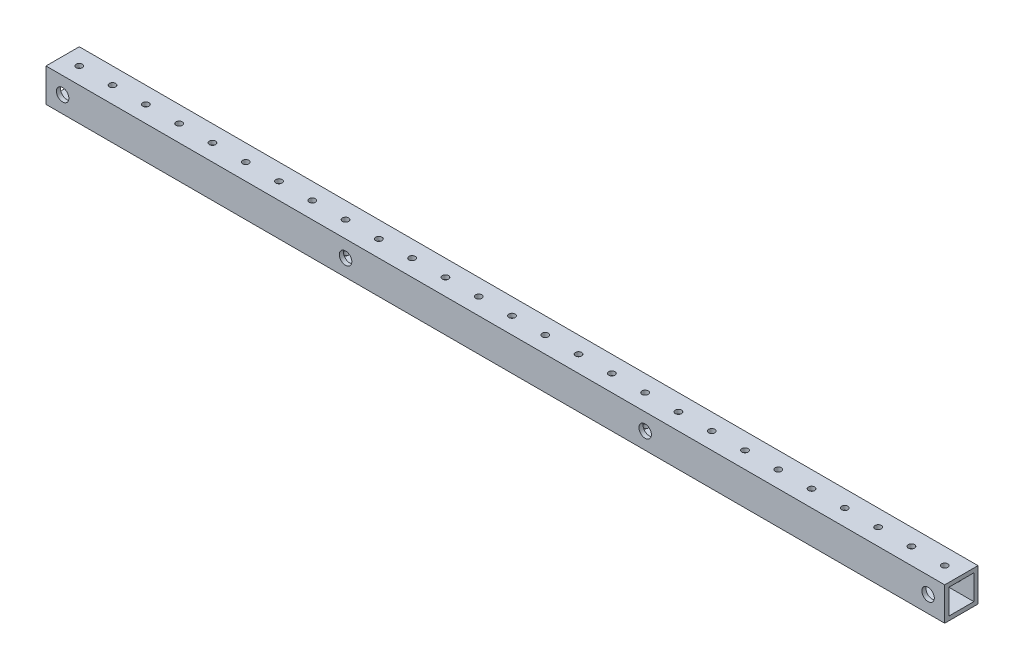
ISO-10303-21;
HEADER;
FILE_DESCRIPTION(('STEP AP214'),'2;1');
FILE_NAME('part.step','',(''),(''),'','','');
FILE_SCHEMA(('AUTOMOTIVE_DESIGN { 1 0 10303 214 1 1 1 1 }'));
ENDSEC;
DATA;
#1=APPLICATION_CONTEXT('core data for automotive mechanical design processes');
#2=APPLICATION_PROTOCOL_DEFINITION('international standard','automotive_design',2000,#1);
#3=PRODUCT_CONTEXT('',#1,'mechanical');
#4=PRODUCT('Part','Part','',(#3));
#5=PRODUCT_RELATED_PRODUCT_CATEGORY('part','',(#4));
#6=PRODUCT_DEFINITION_FORMATION('','',#4);
#7=PRODUCT_DEFINITION_CONTEXT('part definition',#1,'design');
#8=PRODUCT_DEFINITION('design','',#6,#7);
#9=PRODUCT_DEFINITION_SHAPE('','',#8);
#10=(LENGTH_UNIT() NAMED_UNIT(*) SI_UNIT(.MILLI.,.METRE.));
#11=(NAMED_UNIT(*) PLANE_ANGLE_UNIT() SI_UNIT($,.RADIAN.));
#12=(NAMED_UNIT(*) SI_UNIT($,.STERADIAN.) SOLID_ANGLE_UNIT());
#13=UNCERTAINTY_MEASURE_WITH_UNIT(LENGTH_MEASURE(1.E-05),#10,'distance_accuracy_value','');
#14=(GEOMETRIC_REPRESENTATION_CONTEXT(3) GLOBAL_UNCERTAINTY_ASSIGNED_CONTEXT((#13)) GLOBAL_UNIT_ASSIGNED_CONTEXT((#10,
#11,#12)) REPRESENTATION_CONTEXT('',''));
#15=CARTESIAN_POINT('',(0.,0.,0.));
#16=DIRECTION('',(0.,0.,1.));
#17=DIRECTION('',(1.,0.,0.));
#18=AXIS2_PLACEMENT_3D('',#15,#16,#17);
#19=CARTESIAN_POINT('',(342.9,0.,0.));
#20=DIRECTION('',(-1.,0.,0.));
#21=DIRECTION('',(0.,0.,1.));
#22=AXIS2_PLACEMENT_3D('',#19,#20,#21);
#23=PLANE('',#22);
#24=DIRECTION('',(0.,1.,0.));
#25=VECTOR('',#24,1.);
#26=CARTESIAN_POINT('',(342.9,-12.7,-12.7));
#27=LINE('',#26,#25);
#28=CARTESIAN_POINT('',(342.9,-12.7,-12.7));
#29=VERTEX_POINT('',#28);
#30=CARTESIAN_POINT('',(342.9,12.7,-12.7));
#31=VERTEX_POINT('',#30);
#32=EDGE_CURVE('E140',#29,#31,#27,.T.);
#33=ORIENTED_EDGE('',*,*,#32,.T.);
#34=DIRECTION('',(0.,0.,1.));
#35=VECTOR('',#34,1.);
#36=CARTESIAN_POINT('',(342.9,12.7,12.7));
#37=LINE('',#36,#35);
#38=CARTESIAN_POINT('',(342.9,12.7,12.7));
#39=VERTEX_POINT('',#38);
#40=EDGE_CURVE('E143',#31,#39,#37,.T.);
#41=ORIENTED_EDGE('',*,*,#40,.T.);
#42=DIRECTION('',(0.,-1.,0.));
#43=VECTOR('',#42,1.);
#44=CARTESIAN_POINT('',(342.9,-12.7,12.7));
#45=LINE('',#44,#43);
#46=CARTESIAN_POINT('',(342.9,-12.7,12.7));
#47=VERTEX_POINT('',#46);
#48=EDGE_CURVE('E146',#39,#47,#45,.T.);
#49=ORIENTED_EDGE('',*,*,#48,.T.);
#50=DIRECTION('',(0.,0.,-1.));
#51=VECTOR('',#50,1.);
#52=CARTESIAN_POINT('',(342.9,-12.7,12.7));
#53=LINE('',#52,#51);
#54=EDGE_CURVE('E148',#47,#29,#53,.T.);
#55=ORIENTED_EDGE('',*,*,#54,.T.);
#56=EDGE_LOOP('',(#33,#41,#49,#55));
#57=FACE_BOUND('',#56,.T.);
#58=DIRECTION('',(0.,1.,0.));
#59=VECTOR('',#58,1.);
#60=CARTESIAN_POINT('',(342.9,-9.52499999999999,-9.525));
#61=LINE('',#60,#59);
#62=CARTESIAN_POINT('',(342.9,-9.52499999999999,-9.525));
#63=VERTEX_POINT('',#62);
#64=CARTESIAN_POINT('',(342.9,9.52499999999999,-9.525));
#65=VERTEX_POINT('',#64);
#66=EDGE_CURVE('E102',#63,#65,#61,.T.);
#67=ORIENTED_EDGE('',*,*,#66,.F.);
#68=DIRECTION('',(0.,0.,-1.));
#69=VECTOR('',#68,1.);
#70=CARTESIAN_POINT('',(342.9,-9.52499999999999,9.52499999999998));
#71=LINE('',#70,#69);
#72=CARTESIAN_POINT('',(342.9,-9.52499999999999,9.52499999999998));
#73=VERTEX_POINT('',#72);
#74=EDGE_CURVE('E124',#73,#63,#71,.T.);
#75=ORIENTED_EDGE('',*,*,#74,.F.);
#76=DIRECTION('',(0.,-1.,0.));
#77=VECTOR('',#76,1.);
#78=CARTESIAN_POINT('',(342.9,-9.52499999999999,9.52499999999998));
#79=LINE('',#78,#77);
#80=CARTESIAN_POINT('',(342.9,9.52499999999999,9.52499999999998));
#81=VERTEX_POINT('',#80);
#82=EDGE_CURVE('E122',#81,#73,#79,.T.);
#83=ORIENTED_EDGE('',*,*,#82,.F.);
#84=DIRECTION('',(0.,0.,1.));
#85=VECTOR('',#84,1.);
#86=CARTESIAN_POINT('',(342.9,9.52499999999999,9.52499999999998));
#87=LINE('',#86,#85);
#88=EDGE_CURVE('E110',#65,#81,#87,.T.);
#89=ORIENTED_EDGE('',*,*,#88,.F.);
#90=EDGE_LOOP('',(#67,#75,#83,#89));
#91=FACE_BOUND('',#90,.T.);
#92=ADVANCED_FACE('F35',(#57,#91),#23,.F.);
#93=CARTESIAN_POINT('',(-342.9,0.,0.));
#94=DIRECTION('',(-1.,0.,0.));
#95=DIRECTION('',(0.,0.,1.));
#96=AXIS2_PLACEMENT_3D('',#93,#94,#95);
#97=PLANE('',#96);
#98=DIRECTION('',(0.,1.,0.));
#99=VECTOR('',#98,1.);
#100=CARTESIAN_POINT('',(-342.9,-12.7,-12.7));
#101=LINE('',#100,#99);
#102=CARTESIAN_POINT('',(-342.9,-12.7,-12.7));
#103=VERTEX_POINT('',#102);
#104=CARTESIAN_POINT('',(-342.9,12.7,-12.7));
#105=VERTEX_POINT('',#104);
#106=EDGE_CURVE('E118',#103,#105,#101,.T.);
#107=ORIENTED_EDGE('',*,*,#106,.F.);
#108=DIRECTION('',(0.,0.,-1.));
#109=VECTOR('',#108,1.);
#110=CARTESIAN_POINT('',(-342.9,-12.7,12.7));
#111=LINE('',#110,#109);
#112=CARTESIAN_POINT('',(-342.9,-12.7,12.7));
#113=VERTEX_POINT('',#112);
#114=EDGE_CURVE('E144',#113,#103,#111,.T.);
#115=ORIENTED_EDGE('',*,*,#114,.F.);
#116=DIRECTION('',(0.,-1.,0.));
#117=VECTOR('',#116,1.);
#118=CARTESIAN_POINT('',(-342.9,-12.7,12.7));
#119=LINE('',#118,#117);
#120=CARTESIAN_POINT('',(-342.9,12.7,12.7));
#121=VERTEX_POINT('',#120);
#122=EDGE_CURVE('E155',#121,#113,#119,.T.);
#123=ORIENTED_EDGE('',*,*,#122,.F.);
#124=DIRECTION('',(0.,0.,1.));
#125=VECTOR('',#124,1.);
#126=CARTESIAN_POINT('',(-342.9,12.7,12.7));
#127=LINE('',#126,#125);
#128=EDGE_CURVE('E153',#105,#121,#127,.T.);
#129=ORIENTED_EDGE('',*,*,#128,.F.);
#130=EDGE_LOOP('',(#107,#115,#123,#129));
#131=FACE_BOUND('',#130,.T.);
#132=DIRECTION('',(0.,0.,-1.));
#133=VECTOR('',#132,1.);
#134=CARTESIAN_POINT('',(-342.9,-9.52499999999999,9.52499999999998));
#135=LINE('',#134,#133);
#136=CARTESIAN_POINT('',(-342.9,-9.52499999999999,9.52499999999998));
#137=VERTEX_POINT('',#136);
#138=CARTESIAN_POINT('',(-342.9,-9.52499999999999,-9.525));
#139=VERTEX_POINT('',#138);
#140=EDGE_CURVE('E111',#137,#139,#135,.T.);
#141=ORIENTED_EDGE('',*,*,#140,.T.);
#142=DIRECTION('',(0.,1.,0.));
#143=VECTOR('',#142,1.);
#144=CARTESIAN_POINT('',(-342.9,-9.52499999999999,-9.525));
#145=LINE('',#144,#143);
#146=CARTESIAN_POINT('',(-342.9,9.52499999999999,-9.525));
#147=VERTEX_POINT('',#146);
#148=EDGE_CURVE('E60',#139,#147,#145,.T.);
#149=ORIENTED_EDGE('',*,*,#148,.T.);
#150=DIRECTION('',(0.,0.,1.));
#151=VECTOR('',#150,1.);
#152=CARTESIAN_POINT('',(-342.9,9.52499999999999,9.52499999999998));
#153=LINE('',#152,#151);
#154=CARTESIAN_POINT('',(-342.9,9.52499999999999,9.52499999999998));
#155=VERTEX_POINT('',#154);
#156=EDGE_CURVE('E117',#147,#155,#153,.T.);
#157=ORIENTED_EDGE('',*,*,#156,.T.);
#158=DIRECTION('',(0.,-1.,0.));
#159=VECTOR('',#158,1.);
#160=CARTESIAN_POINT('',(-342.9,-9.52499999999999,9.52499999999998));
#161=LINE('',#160,#159);
#162=EDGE_CURVE('E132',#155,#137,#161,.T.);
#163=ORIENTED_EDGE('',*,*,#162,.T.);
#164=EDGE_LOOP('',(#141,#149,#157,#163));
#165=FACE_BOUND('',#164,.T.);
#166=ADVANCED_FACE('F526',(#131,#165),#97,.T.);
#167=CARTESIAN_POINT('',(342.9,-12.7,-12.7));
#168=DIRECTION('',(0.,0.,1.));
#169=DIRECTION('',(1.,0.,0.));
#170=AXIS2_PLACEMENT_3D('',#167,#168,#169);
#171=PLANE('',#170);
#172=CARTESIAN_POINT('',(-330.2,0.,-12.7));
#173=DIRECTION('',(0.,0.,1.));
#174=DIRECTION('',(1.,0.,0.));
#175=AXIS2_PLACEMENT_3D('',#172,#173,#174);
#176=CIRCLE('',#175,2.48920000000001);
#177=CARTESIAN_POINT('',(-327.7108,0.,-12.7));
#178=VERTEX_POINT('',#177);
#179=EDGE_CURVE('E805',#178,#178,#176,.T.);
#180=ORIENTED_EDGE('',*,*,#179,.T.);
#181=EDGE_LOOP('',(#180));
#182=FACE_BOUND('',#181,.T.);
#183=CARTESIAN_POINT('',(-114.3,0.,-12.7));
#184=DIRECTION('',(0.,0.,1.));
#185=DIRECTION('',(1.,0.,0.));
#186=AXIS2_PLACEMENT_3D('',#183,#184,#185);
#187=CIRCLE('',#186,2.4892);
#188=CARTESIAN_POINT('',(-111.8108,0.,-12.7));
#189=VERTEX_POINT('',#188);
#190=EDGE_CURVE('E814',#189,#189,#187,.T.);
#191=ORIENTED_EDGE('',*,*,#190,.T.);
#192=EDGE_LOOP('',(#191));
#193=FACE_BOUND('',#192,.T.);
#194=CARTESIAN_POINT('',(114.3,0.,-12.7));
#195=DIRECTION('',(0.,0.,1.));
#196=DIRECTION('',(1.,0.,0.));
#197=AXIS2_PLACEMENT_3D('',#194,#195,#196);
#198=CIRCLE('',#197,2.4892);
#199=CARTESIAN_POINT('',(116.7892,0.,-12.7));
#200=VERTEX_POINT('',#199);
#201=EDGE_CURVE('E820',#200,#200,#198,.T.);
#202=ORIENTED_EDGE('',*,*,#201,.T.);
#203=EDGE_LOOP('',(#202));
#204=FACE_BOUND('',#203,.T.);
#205=CARTESIAN_POINT('',(330.2,0.,-12.7));
#206=DIRECTION('',(0.,0.,1.));
#207=DIRECTION('',(1.,0.,0.));
#208=AXIS2_PLACEMENT_3D('',#205,#206,#207);
#209=CIRCLE('',#208,2.48920000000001);
#210=CARTESIAN_POINT('',(332.6892,0.,-12.7));
#211=VERTEX_POINT('',#210);
#212=EDGE_CURVE('E826',#211,#211,#209,.T.);
#213=ORIENTED_EDGE('',*,*,#212,.T.);
#214=EDGE_LOOP('',(#213));
#215=FACE_BOUND('',#214,.T.);
#216=ORIENTED_EDGE('',*,*,#106,.T.);
#217=DIRECTION('',(-1.,0.,0.));
#218=VECTOR('',#217,1.);
#219=CARTESIAN_POINT('',(342.9,12.7,-12.7));
#220=LINE('',#219,#218);
#221=EDGE_CURVE('E11',#31,#105,#220,.T.);
#222=ORIENTED_EDGE('',*,*,#221,.F.);
#223=ORIENTED_EDGE('',*,*,#32,.F.);
#224=DIRECTION('',(-1.,0.,0.));
#225=VECTOR('',#224,1.);
#226=CARTESIAN_POINT('',(342.9,-12.7,-12.7));
#227=LINE('',#226,#225);
#228=EDGE_CURVE('E150',#29,#103,#227,.T.);
#229=ORIENTED_EDGE('',*,*,#228,.T.);
#230=EDGE_LOOP('',(#216,#222,#223,#229));
#231=FACE_BOUND('',#230,.T.);
#232=ADVANCED_FACE('F37',(#182,#193,#204,#215,#231),#171,.F.);
#233=CARTESIAN_POINT('',(342.9,12.7,12.7));
#234=DIRECTION('',(0.,-1.,0.));
#235=DIRECTION('',(0.,0.,-1.));
#236=AXIS2_PLACEMENT_3D('',#233,#234,#235);
#237=PLANE('',#236);
#238=CARTESIAN_POINT('',(330.2,12.7,0.));
#239=DIRECTION('',(0.,1.,0.));
#240=DIRECTION('',(0.,0.,1.));
#241=AXIS2_PLACEMENT_3D('',#238,#239,#240);
#242=CIRCLE('',#241,2.38125000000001);
#243=CARTESIAN_POINT('',(330.2,12.7,2.38125000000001));
#244=VERTEX_POINT('',#243);
#245=EDGE_CURVE('E553',#244,#244,#242,.T.);
#246=ORIENTED_EDGE('',*,*,#245,.F.);
#247=EDGE_LOOP('',(#246));
#248=FACE_BOUND('',#247,.T.);
#249=CARTESIAN_POINT('',(304.8,12.7,0.));
#250=DIRECTION('',(0.,1.,0.));
#251=DIRECTION('',(0.,0.,1.));
#252=AXIS2_PLACEMENT_3D('',#249,#250,#251);
#253=CIRCLE('',#252,2.38125000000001);
#254=CARTESIAN_POINT('',(304.8,12.7,2.38125000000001));
#255=VERTEX_POINT('',#254);
#256=EDGE_CURVE('E299',#255,#255,#253,.T.);
#257=ORIENTED_EDGE('',*,*,#256,.F.);
#258=EDGE_LOOP('',(#257));
#259=FACE_BOUND('',#258,.T.);
#260=CARTESIAN_POINT('',(279.4,12.7,0.));
#261=DIRECTION('',(0.,1.,0.));
#262=DIRECTION('',(0.,0.,1.));
#263=AXIS2_PLACEMENT_3D('',#260,#261,#262);
#264=CIRCLE('',#263,2.38125000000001);
#265=CARTESIAN_POINT('',(279.4,12.7,2.38125000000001));
#266=VERTEX_POINT('',#265);
#267=EDGE_CURVE('E296',#266,#266,#264,.T.);
#268=ORIENTED_EDGE('',*,*,#267,.F.);
#269=EDGE_LOOP('',(#268));
#270=FACE_BOUND('',#269,.T.);
#271=CARTESIAN_POINT('',(254.,12.7,0.));
#272=DIRECTION('',(0.,1.,0.));
#273=DIRECTION('',(0.,0.,1.));
#274=AXIS2_PLACEMENT_3D('',#271,#272,#273);
#275=CIRCLE('',#274,2.38125000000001);
#276=CARTESIAN_POINT('',(254.,12.7,2.38125000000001));
#277=VERTEX_POINT('',#276);
#278=EDGE_CURVE('E315',#277,#277,#275,.T.);
#279=ORIENTED_EDGE('',*,*,#278,.F.);
#280=EDGE_LOOP('',(#279));
#281=FACE_BOUND('',#280,.T.);
#282=CARTESIAN_POINT('',(228.6,12.7,0.));
#283=DIRECTION('',(0.,1.,0.));
#284=DIRECTION('',(0.,0.,1.));
#285=AXIS2_PLACEMENT_3D('',#282,#283,#284);
#286=CIRCLE('',#285,2.38125000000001);
#287=CARTESIAN_POINT('',(228.6,12.7,2.38125000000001));
#288=VERTEX_POINT('',#287);
#289=EDGE_CURVE('E322',#288,#288,#286,.T.);
#290=ORIENTED_EDGE('',*,*,#289,.F.);
#291=EDGE_LOOP('',(#290));
#292=FACE_BOUND('',#291,.T.);
#293=CARTESIAN_POINT('',(203.2,12.7,0.));
#294=DIRECTION('',(0.,1.,0.));
#295=DIRECTION('',(0.,0.,1.));
#296=AXIS2_PLACEMENT_3D('',#293,#294,#295);
#297=CIRCLE('',#296,2.38125000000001);
#298=CARTESIAN_POINT('',(203.2,12.7,2.38125000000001));
#299=VERTEX_POINT('',#298);
#300=EDGE_CURVE('E329',#299,#299,#297,.T.);
#301=ORIENTED_EDGE('',*,*,#300,.F.);
#302=EDGE_LOOP('',(#301));
#303=FACE_BOUND('',#302,.T.);
#304=CARTESIAN_POINT('',(177.8,12.7,0.));
#305=DIRECTION('',(0.,1.,0.));
#306=DIRECTION('',(0.,0.,1.));
#307=AXIS2_PLACEMENT_3D('',#304,#305,#306);
#308=CIRCLE('',#307,2.38125000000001);
#309=CARTESIAN_POINT('',(177.8,12.7,2.38125000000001));
#310=VERTEX_POINT('',#309);
#311=EDGE_CURVE('E336',#310,#310,#308,.T.);
#312=ORIENTED_EDGE('',*,*,#311,.F.);
#313=EDGE_LOOP('',(#312));
#314=FACE_BOUND('',#313,.T.);
#315=CARTESIAN_POINT('',(152.4,12.7,0.));
#316=DIRECTION('',(0.,1.,0.));
#317=DIRECTION('',(0.,0.,1.));
#318=AXIS2_PLACEMENT_3D('',#315,#316,#317);
#319=CIRCLE('',#318,2.38125000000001);
#320=CARTESIAN_POINT('',(152.4,12.7,2.38125000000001));
#321=VERTEX_POINT('',#320);
#322=EDGE_CURVE('E343',#321,#321,#319,.T.);
#323=ORIENTED_EDGE('',*,*,#322,.F.);
#324=EDGE_LOOP('',(#323));
#325=FACE_BOUND('',#324,.T.);
#326=CARTESIAN_POINT('',(127.,12.7,0.));
#327=DIRECTION('',(0.,1.,0.));
#328=DIRECTION('',(0.,0.,1.));
#329=AXIS2_PLACEMENT_3D('',#326,#327,#328);
#330=CIRCLE('',#329,2.38125000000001);
#331=CARTESIAN_POINT('',(127.,12.7,2.38125000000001));
#332=VERTEX_POINT('',#331);
#333=EDGE_CURVE('E350',#332,#332,#330,.T.);
#334=ORIENTED_EDGE('',*,*,#333,.F.);
#335=EDGE_LOOP('',(#334));
#336=FACE_BOUND('',#335,.T.);
#337=CARTESIAN_POINT('',(101.6,12.7,0.));
#338=DIRECTION('',(0.,1.,0.));
#339=DIRECTION('',(0.,0.,1.));
#340=AXIS2_PLACEMENT_3D('',#337,#338,#339);
#341=CIRCLE('',#340,2.38125000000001);
#342=CARTESIAN_POINT('',(101.6,12.7,2.38125000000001));
#343=VERTEX_POINT('',#342);
#344=EDGE_CURVE('E357',#343,#343,#341,.T.);
#345=ORIENTED_EDGE('',*,*,#344,.F.);
#346=EDGE_LOOP('',(#345));
#347=FACE_BOUND('',#346,.T.);
#348=CARTESIAN_POINT('',(76.2,12.7,0.));
#349=DIRECTION('',(0.,1.,0.));
#350=DIRECTION('',(0.,0.,1.));
#351=AXIS2_PLACEMENT_3D('',#348,#349,#350);
#352=CIRCLE('',#351,2.38125000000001);
#353=CARTESIAN_POINT('',(76.2,12.7,2.38125000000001));
#354=VERTEX_POINT('',#353);
#355=EDGE_CURVE('E364',#354,#354,#352,.T.);
#356=ORIENTED_EDGE('',*,*,#355,.F.);
#357=EDGE_LOOP('',(#356));
#358=FACE_BOUND('',#357,.T.);
#359=CARTESIAN_POINT('',(50.8,12.7,0.));
#360=DIRECTION('',(0.,1.,0.));
#361=DIRECTION('',(0.,0.,1.));
#362=AXIS2_PLACEMENT_3D('',#359,#360,#361);
#363=CIRCLE('',#362,2.38125000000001);
#364=CARTESIAN_POINT('',(50.8,12.7,2.38125000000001));
#365=VERTEX_POINT('',#364);
#366=EDGE_CURVE('E371',#365,#365,#363,.T.);
#367=ORIENTED_EDGE('',*,*,#366,.F.);
#368=EDGE_LOOP('',(#367));
#369=FACE_BOUND('',#368,.T.);
#370=CARTESIAN_POINT('',(25.4,12.7,0.));
#371=DIRECTION('',(0.,1.,0.));
#372=DIRECTION('',(0.,0.,1.));
#373=AXIS2_PLACEMENT_3D('',#370,#371,#372);
#374=CIRCLE('',#373,2.38125000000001);
#375=CARTESIAN_POINT('',(25.4,12.7,2.38125000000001));
#376=VERTEX_POINT('',#375);
#377=EDGE_CURVE('E378',#376,#376,#374,.T.);
#378=ORIENTED_EDGE('',*,*,#377,.F.);
#379=EDGE_LOOP('',(#378));
#380=FACE_BOUND('',#379,.T.);
#381=CARTESIAN_POINT('',(0.,12.7,0.));
#382=DIRECTION('',(0.,1.,0.));
#383=DIRECTION('',(0.,0.,1.));
#384=AXIS2_PLACEMENT_3D('',#381,#382,#383);
#385=CIRCLE('',#384,2.38125000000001);
#386=CARTESIAN_POINT('',(0.,12.7,2.38125000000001));
#387=VERTEX_POINT('',#386);
#388=EDGE_CURVE('E385',#387,#387,#385,.T.);
#389=ORIENTED_EDGE('',*,*,#388,.F.);
#390=EDGE_LOOP('',(#389));
#391=FACE_BOUND('',#390,.T.);
#392=CARTESIAN_POINT('',(-25.4,12.7,0.));
#393=DIRECTION('',(0.,1.,0.));
#394=DIRECTION('',(0.,0.,1.));
#395=AXIS2_PLACEMENT_3D('',#392,#393,#394);
#396=CIRCLE('',#395,2.38125000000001);
#397=CARTESIAN_POINT('',(-25.4,12.7,2.38125000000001));
#398=VERTEX_POINT('',#397);
#399=EDGE_CURVE('E392',#398,#398,#396,.T.);
#400=ORIENTED_EDGE('',*,*,#399,.F.);
#401=EDGE_LOOP('',(#400));
#402=FACE_BOUND('',#401,.T.);
#403=CARTESIAN_POINT('',(-50.8,12.7,0.));
#404=DIRECTION('',(0.,1.,0.));
#405=DIRECTION('',(0.,0.,1.));
#406=AXIS2_PLACEMENT_3D('',#403,#404,#405);
#407=CIRCLE('',#406,2.38125000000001);
#408=CARTESIAN_POINT('',(-50.8,12.7,2.38125000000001));
#409=VERTEX_POINT('',#408);
#410=EDGE_CURVE('E399',#409,#409,#407,.T.);
#411=ORIENTED_EDGE('',*,*,#410,.F.);
#412=EDGE_LOOP('',(#411));
#413=FACE_BOUND('',#412,.T.);
#414=CARTESIAN_POINT('',(-76.2,12.7,0.));
#415=DIRECTION('',(0.,1.,0.));
#416=DIRECTION('',(0.,0.,1.));
#417=AXIS2_PLACEMENT_3D('',#414,#415,#416);
#418=CIRCLE('',#417,2.38125000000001);
#419=CARTESIAN_POINT('',(-76.2,12.7,2.38125000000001));
#420=VERTEX_POINT('',#419);
#421=EDGE_CURVE('E406',#420,#420,#418,.T.);
#422=ORIENTED_EDGE('',*,*,#421,.F.);
#423=EDGE_LOOP('',(#422));
#424=FACE_BOUND('',#423,.T.);
#425=CARTESIAN_POINT('',(-101.6,12.7,0.));
#426=DIRECTION('',(0.,1.,0.));
#427=DIRECTION('',(0.,0.,1.));
#428=AXIS2_PLACEMENT_3D('',#425,#426,#427);
#429=CIRCLE('',#428,2.38125000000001);
#430=CARTESIAN_POINT('',(-101.6,12.7,2.38125000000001));
#431=VERTEX_POINT('',#430);
#432=EDGE_CURVE('E413',#431,#431,#429,.T.);
#433=ORIENTED_EDGE('',*,*,#432,.F.);
#434=EDGE_LOOP('',(#433));
#435=FACE_BOUND('',#434,.T.);
#436=CARTESIAN_POINT('',(-127.,12.7,0.));
#437=DIRECTION('',(0.,1.,0.));
#438=DIRECTION('',(0.,0.,1.));
#439=AXIS2_PLACEMENT_3D('',#436,#437,#438);
#440=CIRCLE('',#439,2.38125000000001);
#441=CARTESIAN_POINT('',(-127.,12.7,2.38125000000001));
#442=VERTEX_POINT('',#441);
#443=EDGE_CURVE('E420',#442,#442,#440,.T.);
#444=ORIENTED_EDGE('',*,*,#443,.F.);
#445=EDGE_LOOP('',(#444));
#446=FACE_BOUND('',#445,.T.);
#447=CARTESIAN_POINT('',(-152.4,12.7,0.));
#448=DIRECTION('',(0.,1.,0.));
#449=DIRECTION('',(0.,0.,1.));
#450=AXIS2_PLACEMENT_3D('',#447,#448,#449);
#451=CIRCLE('',#450,2.38125000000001);
#452=CARTESIAN_POINT('',(-152.4,12.7,2.38125000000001));
#453=VERTEX_POINT('',#452);
#454=EDGE_CURVE('E427',#453,#453,#451,.T.);
#455=ORIENTED_EDGE('',*,*,#454,.F.);
#456=EDGE_LOOP('',(#455));
#457=FACE_BOUND('',#456,.T.);
#458=CARTESIAN_POINT('',(-177.8,12.7,0.));
#459=DIRECTION('',(0.,1.,0.));
#460=DIRECTION('',(0.,0.,1.));
#461=AXIS2_PLACEMENT_3D('',#458,#459,#460);
#462=CIRCLE('',#461,2.38125000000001);
#463=CARTESIAN_POINT('',(-177.8,12.7,2.38125000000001));
#464=VERTEX_POINT('',#463);
#465=EDGE_CURVE('E434',#464,#464,#462,.T.);
#466=ORIENTED_EDGE('',*,*,#465,.F.);
#467=EDGE_LOOP('',(#466));
#468=FACE_BOUND('',#467,.T.);
#469=CARTESIAN_POINT('',(-203.2,12.7,0.));
#470=DIRECTION('',(0.,1.,0.));
#471=DIRECTION('',(0.,0.,1.));
#472=AXIS2_PLACEMENT_3D('',#469,#470,#471);
#473=CIRCLE('',#472,2.38125000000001);
#474=CARTESIAN_POINT('',(-203.2,12.7,2.38125000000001));
#475=VERTEX_POINT('',#474);
#476=EDGE_CURVE('E441',#475,#475,#473,.T.);
#477=ORIENTED_EDGE('',*,*,#476,.F.);
#478=EDGE_LOOP('',(#477));
#479=FACE_BOUND('',#478,.T.);
#480=CARTESIAN_POINT('',(-228.6,12.7,0.));
#481=DIRECTION('',(0.,1.,0.));
#482=DIRECTION('',(0.,0.,1.));
#483=AXIS2_PLACEMENT_3D('',#480,#481,#482);
#484=CIRCLE('',#483,2.38125000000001);
#485=CARTESIAN_POINT('',(-228.6,12.7,2.38125000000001));
#486=VERTEX_POINT('',#485);
#487=EDGE_CURVE('E448',#486,#486,#484,.T.);
#488=ORIENTED_EDGE('',*,*,#487,.F.);
#489=EDGE_LOOP('',(#488));
#490=FACE_BOUND('',#489,.T.);
#491=CARTESIAN_POINT('',(-254.,12.7,0.));
#492=DIRECTION('',(0.,1.,0.));
#493=DIRECTION('',(0.,0.,1.));
#494=AXIS2_PLACEMENT_3D('',#491,#492,#493);
#495=CIRCLE('',#494,2.38125000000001);
#496=CARTESIAN_POINT('',(-254.,12.7,2.38125000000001));
#497=VERTEX_POINT('',#496);
#498=EDGE_CURVE('E455',#497,#497,#495,.T.);
#499=ORIENTED_EDGE('',*,*,#498,.F.);
#500=EDGE_LOOP('',(#499));
#501=FACE_BOUND('',#500,.T.);
#502=CARTESIAN_POINT('',(-279.4,12.7,0.));
#503=DIRECTION('',(0.,1.,0.));
#504=DIRECTION('',(0.,0.,1.));
#505=AXIS2_PLACEMENT_3D('',#502,#503,#504);
#506=CIRCLE('',#505,2.38125000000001);
#507=CARTESIAN_POINT('',(-279.4,12.7,2.38125000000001));
#508=VERTEX_POINT('',#507);
#509=EDGE_CURVE('E462',#508,#508,#506,.T.);
#510=ORIENTED_EDGE('',*,*,#509,.F.);
#511=EDGE_LOOP('',(#510));
#512=FACE_BOUND('',#511,.T.);
#513=CARTESIAN_POINT('',(-304.8,12.7,0.));
#514=DIRECTION('',(0.,1.,0.));
#515=DIRECTION('',(0.,0.,1.));
#516=AXIS2_PLACEMENT_3D('',#513,#514,#515);
#517=CIRCLE('',#516,2.38125000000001);
#518=CARTESIAN_POINT('',(-304.8,12.7,2.38125000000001));
#519=VERTEX_POINT('',#518);
#520=EDGE_CURVE('E469',#519,#519,#517,.T.);
#521=ORIENTED_EDGE('',*,*,#520,.F.);
#522=EDGE_LOOP('',(#521));
#523=FACE_BOUND('',#522,.T.);
#524=CARTESIAN_POINT('',(-330.2,12.7,0.));
#525=DIRECTION('',(0.,1.,0.));
#526=DIRECTION('',(0.,0.,1.));
#527=AXIS2_PLACEMENT_3D('',#524,#525,#526);
#528=CIRCLE('',#527,2.38125000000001);
#529=CARTESIAN_POINT('',(-330.2,12.7,2.38125000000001));
#530=VERTEX_POINT('',#529);
#531=EDGE_CURVE('E476',#530,#530,#528,.T.);
#532=ORIENTED_EDGE('',*,*,#531,.F.);
#533=EDGE_LOOP('',(#532));
#534=FACE_BOUND('',#533,.T.);
#535=ORIENTED_EDGE('',*,*,#128,.T.);
#536=DIRECTION('',(-1.,0.,0.));
#537=VECTOR('',#536,1.);
#538=CARTESIAN_POINT('',(342.9,12.7,12.7));
#539=LINE('',#538,#537);
#540=EDGE_CURVE('E44',#39,#121,#539,.T.);
#541=ORIENTED_EDGE('',*,*,#540,.F.);
#542=ORIENTED_EDGE('',*,*,#40,.F.);
#543=ORIENTED_EDGE('',*,*,#221,.T.);
#544=EDGE_LOOP('',(#535,#541,#542,#543));
#545=FACE_BOUND('',#544,.T.);
#546=ADVANCED_FACE('F542',(#248,#259,#270,#281,#292,#303,#314,#325,#336,#347,#358,#369,#380,
#391,#402,#413,#424,#435,#446,#457,#468,#479,#490,#501,#512,#523,#534,#545),#237,.F.);
#547=CARTESIAN_POINT('',(342.9,-12.7,12.7));
#548=DIRECTION('',(0.,0.,-1.));
#549=DIRECTION('',(-1.,0.,0.));
#550=AXIS2_PLACEMENT_3D('',#547,#548,#549);
#551=PLANE('',#550);
#552=CARTESIAN_POINT('',(330.2,0.,12.7));
#553=DIRECTION('',(0.,0.,-1.));
#554=DIRECTION('',(-1.,0.,0.));
#555=AXIS2_PLACEMENT_3D('',#552,#553,#554);
#556=CIRCLE('',#555,4.76250000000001);
#557=CARTESIAN_POINT('',(334.9625,0.,12.7));
#558=VERTEX_POINT('',#557);
#559=EDGE_CURVE('E486',#558,#558,#556,.T.);
#560=ORIENTED_EDGE('',*,*,#559,.T.);
#561=EDGE_LOOP('',(#560));
#562=FACE_BOUND('',#561,.T.);
#563=CARTESIAN_POINT('',(114.3,0.,12.7));
#564=DIRECTION('',(0.,0.,-1.));
#565=DIRECTION('',(-1.,0.,0.));
#566=AXIS2_PLACEMENT_3D('',#563,#564,#565);
#567=CIRCLE('',#566,4.76250000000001);
#568=CARTESIAN_POINT('',(119.0625,0.,12.7));
#569=VERTEX_POINT('',#568);
#570=EDGE_CURVE('E492',#569,#569,#567,.T.);
#571=ORIENTED_EDGE('',*,*,#570,.T.);
#572=EDGE_LOOP('',(#571));
#573=FACE_BOUND('',#572,.T.);
#574=CARTESIAN_POINT('',(-114.3,0.,12.7));
#575=DIRECTION('',(0.,0.,-1.));
#576=DIRECTION('',(-1.,0.,0.));
#577=AXIS2_PLACEMENT_3D('',#574,#575,#576);
#578=CIRCLE('',#577,4.76250000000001);
#579=CARTESIAN_POINT('',(-109.5375,0.,12.7));
#580=VERTEX_POINT('',#579);
#581=EDGE_CURVE('E498',#580,#580,#578,.T.);
#582=ORIENTED_EDGE('',*,*,#581,.T.);
#583=EDGE_LOOP('',(#582));
#584=FACE_BOUND('',#583,.T.);
#585=CARTESIAN_POINT('',(-330.2,0.,12.7));
#586=DIRECTION('',(0.,0.,-1.));
#587=DIRECTION('',(-1.,0.,0.));
#588=AXIS2_PLACEMENT_3D('',#585,#586,#587);
#589=CIRCLE('',#588,4.76250000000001);
#590=CARTESIAN_POINT('',(-325.4375,0.,12.7));
#591=VERTEX_POINT('',#590);
#592=EDGE_CURVE('E130',#591,#591,#589,.T.);
#593=ORIENTED_EDGE('',*,*,#592,.T.);
#594=EDGE_LOOP('',(#593));
#595=FACE_BOUND('',#594,.T.);
#596=ORIENTED_EDGE('',*,*,#122,.T.);
#597=DIRECTION('',(-1.,0.,0.));
#598=VECTOR('',#597,1.);
#599=CARTESIAN_POINT('',(342.9,-12.7,12.7));
#600=LINE('',#599,#598);
#601=EDGE_CURVE('E160',#47,#113,#600,.T.);
#602=ORIENTED_EDGE('',*,*,#601,.F.);
#603=ORIENTED_EDGE('',*,*,#48,.F.);
#604=ORIENTED_EDGE('',*,*,#540,.T.);
#605=EDGE_LOOP('',(#596,#602,#603,#604));
#606=FACE_BOUND('',#605,.T.);
#607=ADVANCED_FACE('F506',(#562,#573,#584,#595,#606),#551,.F.);
#608=CARTESIAN_POINT('',(342.9,-12.7,12.7));
#609=DIRECTION('',(0.,1.,0.));
#610=DIRECTION('',(0.,0.,1.));
#611=AXIS2_PLACEMENT_3D('',#608,#609,#610);
#612=PLANE('',#611);
#613=CARTESIAN_POINT('',(330.2,-12.7,0.));
#614=DIRECTION('',(0.,1.,0.));
#615=DIRECTION('',(0.,0.,1.));
#616=AXIS2_PLACEMENT_3D('',#613,#614,#615);
#617=CIRCLE('',#616,2.38125000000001);
#618=CARTESIAN_POINT('',(330.2,-12.7,2.38125000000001));
#619=VERTEX_POINT('',#618);
#620=EDGE_CURVE('E831',#619,#619,#617,.T.);
#621=ORIENTED_EDGE('',*,*,#620,.T.);
#622=EDGE_LOOP('',(#621));
#623=FACE_BOUND('',#622,.T.);
#624=CARTESIAN_POINT('',(304.8,-12.7,0.));
#625=DIRECTION('',(0.,1.,0.));
#626=DIRECTION('',(0.,0.,1.));
#627=AXIS2_PLACEMENT_3D('',#624,#625,#626);
#628=CIRCLE('',#627,2.38125000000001);
#629=CARTESIAN_POINT('',(304.8,-12.7,2.38125000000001));
#630=VERTEX_POINT('',#629);
#631=EDGE_CURVE('E292',#630,#630,#628,.T.);
#632=ORIENTED_EDGE('',*,*,#631,.T.);
#633=EDGE_LOOP('',(#632));
#634=FACE_BOUND('',#633,.T.);
#635=CARTESIAN_POINT('',(279.4,-12.7,0.));
#636=DIRECTION('',(0.,1.,0.));
#637=DIRECTION('',(0.,0.,1.));
#638=AXIS2_PLACEMENT_3D('',#635,#636,#637);
#639=CIRCLE('',#638,2.38125000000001);
#640=CARTESIAN_POINT('',(279.4,-12.7,2.38125000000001));
#641=VERTEX_POINT('',#640);
#642=EDGE_CURVE('E288',#641,#641,#639,.T.);
#643=ORIENTED_EDGE('',*,*,#642,.T.);
#644=EDGE_LOOP('',(#643));
#645=FACE_BOUND('',#644,.T.);
#646=CARTESIAN_POINT('',(254.,-12.7,0.));
#647=DIRECTION('',(0.,1.,0.));
#648=DIRECTION('',(0.,0.,1.));
#649=AXIS2_PLACEMENT_3D('',#646,#647,#648);
#650=CIRCLE('',#649,2.38125000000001);
#651=CARTESIAN_POINT('',(254.,-12.7,2.38125000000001));
#652=VERTEX_POINT('',#651);
#653=EDGE_CURVE('E284',#652,#652,#650,.T.);
#654=ORIENTED_EDGE('',*,*,#653,.T.);
#655=EDGE_LOOP('',(#654));
#656=FACE_BOUND('',#655,.T.);
#657=CARTESIAN_POINT('',(228.6,-12.7,0.));
#658=DIRECTION('',(0.,1.,0.));
#659=DIRECTION('',(0.,0.,1.));
#660=AXIS2_PLACEMENT_3D('',#657,#658,#659);
#661=CIRCLE('',#660,2.38125000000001);
#662=CARTESIAN_POINT('',(228.6,-12.7,2.38125000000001));
#663=VERTEX_POINT('',#662);
#664=EDGE_CURVE('E279',#663,#663,#661,.T.);
#665=ORIENTED_EDGE('',*,*,#664,.T.);
#666=EDGE_LOOP('',(#665));
#667=FACE_BOUND('',#666,.T.);
#668=CARTESIAN_POINT('',(203.2,-12.7,0.));
#669=DIRECTION('',(0.,1.,0.));
#670=DIRECTION('',(0.,0.,1.));
#671=AXIS2_PLACEMENT_3D('',#668,#669,#670);
#672=CIRCLE('',#671,2.38125000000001);
#673=CARTESIAN_POINT('',(203.2,-12.7,2.38125000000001));
#674=VERTEX_POINT('',#673);
#675=EDGE_CURVE('E274',#674,#674,#672,.T.);
#676=ORIENTED_EDGE('',*,*,#675,.T.);
#677=EDGE_LOOP('',(#676));
#678=FACE_BOUND('',#677,.T.);
#679=CARTESIAN_POINT('',(177.8,-12.7,0.));
#680=DIRECTION('',(0.,1.,0.));
#681=DIRECTION('',(0.,0.,1.));
#682=AXIS2_PLACEMENT_3D('',#679,#680,#681);
#683=CIRCLE('',#682,2.38125000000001);
#684=CARTESIAN_POINT('',(177.8,-12.7,2.38125000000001));
#685=VERTEX_POINT('',#684);
#686=EDGE_CURVE('E269',#685,#685,#683,.T.);
#687=ORIENTED_EDGE('',*,*,#686,.T.);
#688=EDGE_LOOP('',(#687));
#689=FACE_BOUND('',#688,.T.);
#690=CARTESIAN_POINT('',(152.4,-12.7,0.));
#691=DIRECTION('',(0.,1.,0.));
#692=DIRECTION('',(0.,0.,1.));
#693=AXIS2_PLACEMENT_3D('',#690,#691,#692);
#694=CIRCLE('',#693,2.38125000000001);
#695=CARTESIAN_POINT('',(152.4,-12.7,2.38125000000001));
#696=VERTEX_POINT('',#695);
#697=EDGE_CURVE('E264',#696,#696,#694,.T.);
#698=ORIENTED_EDGE('',*,*,#697,.T.);
#699=EDGE_LOOP('',(#698));
#700=FACE_BOUND('',#699,.T.);
#701=CARTESIAN_POINT('',(127.,-12.7,0.));
#702=DIRECTION('',(0.,1.,0.));
#703=DIRECTION('',(0.,0.,1.));
#704=AXIS2_PLACEMENT_3D('',#701,#702,#703);
#705=CIRCLE('',#704,2.38125000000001);
#706=CARTESIAN_POINT('',(127.,-12.7,2.38125000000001));
#707=VERTEX_POINT('',#706);
#708=EDGE_CURVE('E259',#707,#707,#705,.T.);
#709=ORIENTED_EDGE('',*,*,#708,.T.);
#710=EDGE_LOOP('',(#709));
#711=FACE_BOUND('',#710,.T.);
#712=CARTESIAN_POINT('',(101.6,-12.7,0.));
#713=DIRECTION('',(0.,1.,0.));
#714=DIRECTION('',(0.,0.,1.));
#715=AXIS2_PLACEMENT_3D('',#712,#713,#714);
#716=CIRCLE('',#715,2.38125000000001);
#717=CARTESIAN_POINT('',(101.6,-12.7,2.38125000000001));
#718=VERTEX_POINT('',#717);
#719=EDGE_CURVE('E254',#718,#718,#716,.T.);
#720=ORIENTED_EDGE('',*,*,#719,.T.);
#721=EDGE_LOOP('',(#720));
#722=FACE_BOUND('',#721,.T.);
#723=CARTESIAN_POINT('',(76.2,-12.7,0.));
#724=DIRECTION('',(0.,1.,0.));
#725=DIRECTION('',(0.,0.,1.));
#726=AXIS2_PLACEMENT_3D('',#723,#724,#725);
#727=CIRCLE('',#726,2.38125000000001);
#728=CARTESIAN_POINT('',(76.2,-12.7,2.38125000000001));
#729=VERTEX_POINT('',#728);
#730=EDGE_CURVE('E249',#729,#729,#727,.T.);
#731=ORIENTED_EDGE('',*,*,#730,.T.);
#732=EDGE_LOOP('',(#731));
#733=FACE_BOUND('',#732,.T.);
#734=CARTESIAN_POINT('',(50.8,-12.7,0.));
#735=DIRECTION('',(0.,1.,0.));
#736=DIRECTION('',(0.,0.,1.));
#737=AXIS2_PLACEMENT_3D('',#734,#735,#736);
#738=CIRCLE('',#737,2.38125000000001);
#739=CARTESIAN_POINT('',(50.8,-12.7,2.38125000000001));
#740=VERTEX_POINT('',#739);
#741=EDGE_CURVE('E244',#740,#740,#738,.T.);
#742=ORIENTED_EDGE('',*,*,#741,.T.);
#743=EDGE_LOOP('',(#742));
#744=FACE_BOUND('',#743,.T.);
#745=CARTESIAN_POINT('',(25.4,-12.7,0.));
#746=DIRECTION('',(0.,1.,0.));
#747=DIRECTION('',(0.,0.,1.));
#748=AXIS2_PLACEMENT_3D('',#745,#746,#747);
#749=CIRCLE('',#748,2.38125000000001);
#750=CARTESIAN_POINT('',(25.4,-12.7,2.38125000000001));
#751=VERTEX_POINT('',#750);
#752=EDGE_CURVE('E239',#751,#751,#749,.T.);
#753=ORIENTED_EDGE('',*,*,#752,.T.);
#754=EDGE_LOOP('',(#753));
#755=FACE_BOUND('',#754,.T.);
#756=CARTESIAN_POINT('',(0.,-12.7,0.));
#757=DIRECTION('',(0.,1.,0.));
#758=DIRECTION('',(0.,0.,1.));
#759=AXIS2_PLACEMENT_3D('',#756,#757,#758);
#760=CIRCLE('',#759,2.38125000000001);
#761=CARTESIAN_POINT('',(0.,-12.7,2.38125000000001));
#762=VERTEX_POINT('',#761);
#763=EDGE_CURVE('E234',#762,#762,#760,.T.);
#764=ORIENTED_EDGE('',*,*,#763,.T.);
#765=EDGE_LOOP('',(#764));
#766=FACE_BOUND('',#765,.T.);
#767=CARTESIAN_POINT('',(-25.4,-12.7,0.));
#768=DIRECTION('',(0.,1.,0.));
#769=DIRECTION('',(0.,0.,1.));
#770=AXIS2_PLACEMENT_3D('',#767,#768,#769);
#771=CIRCLE('',#770,2.38125000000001);
#772=CARTESIAN_POINT('',(-25.4,-12.7,2.38125000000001));
#773=VERTEX_POINT('',#772);
#774=EDGE_CURVE('E229',#773,#773,#771,.T.);
#775=ORIENTED_EDGE('',*,*,#774,.T.);
#776=EDGE_LOOP('',(#775));
#777=FACE_BOUND('',#776,.T.);
#778=CARTESIAN_POINT('',(-50.8,-12.7,0.));
#779=DIRECTION('',(0.,1.,0.));
#780=DIRECTION('',(0.,0.,1.));
#781=AXIS2_PLACEMENT_3D('',#778,#779,#780);
#782=CIRCLE('',#781,2.38125000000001);
#783=CARTESIAN_POINT('',(-50.8,-12.7,2.38125000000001));
#784=VERTEX_POINT('',#783);
#785=EDGE_CURVE('E224',#784,#784,#782,.T.);
#786=ORIENTED_EDGE('',*,*,#785,.T.);
#787=EDGE_LOOP('',(#786));
#788=FACE_BOUND('',#787,.T.);
#789=CARTESIAN_POINT('',(-76.2,-12.7,0.));
#790=DIRECTION('',(0.,1.,0.));
#791=DIRECTION('',(0.,0.,1.));
#792=AXIS2_PLACEMENT_3D('',#789,#790,#791);
#793=CIRCLE('',#792,2.38125000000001);
#794=CARTESIAN_POINT('',(-76.2,-12.7,2.38125000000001));
#795=VERTEX_POINT('',#794);
#796=EDGE_CURVE('E219',#795,#795,#793,.T.);
#797=ORIENTED_EDGE('',*,*,#796,.T.);
#798=EDGE_LOOP('',(#797));
#799=FACE_BOUND('',#798,.T.);
#800=CARTESIAN_POINT('',(-101.6,-12.7,0.));
#801=DIRECTION('',(0.,1.,0.));
#802=DIRECTION('',(0.,0.,1.));
#803=AXIS2_PLACEMENT_3D('',#800,#801,#802);
#804=CIRCLE('',#803,2.38125000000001);
#805=CARTESIAN_POINT('',(-101.6,-12.7,2.38125000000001));
#806=VERTEX_POINT('',#805);
#807=EDGE_CURVE('E214',#806,#806,#804,.T.);
#808=ORIENTED_EDGE('',*,*,#807,.T.);
#809=EDGE_LOOP('',(#808));
#810=FACE_BOUND('',#809,.T.);
#811=CARTESIAN_POINT('',(-127.,-12.7,0.));
#812=DIRECTION('',(0.,1.,0.));
#813=DIRECTION('',(0.,0.,1.));
#814=AXIS2_PLACEMENT_3D('',#811,#812,#813);
#815=CIRCLE('',#814,2.38125000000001);
#816=CARTESIAN_POINT('',(-127.,-12.7,2.38125000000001));
#817=VERTEX_POINT('',#816);
#818=EDGE_CURVE('E209',#817,#817,#815,.T.);
#819=ORIENTED_EDGE('',*,*,#818,.T.);
#820=EDGE_LOOP('',(#819));
#821=FACE_BOUND('',#820,.T.);
#822=CARTESIAN_POINT('',(-152.4,-12.7,0.));
#823=DIRECTION('',(0.,1.,0.));
#824=DIRECTION('',(0.,0.,1.));
#825=AXIS2_PLACEMENT_3D('',#822,#823,#824);
#826=CIRCLE('',#825,2.38125000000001);
#827=CARTESIAN_POINT('',(-152.4,-12.7,2.38125000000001));
#828=VERTEX_POINT('',#827);
#829=EDGE_CURVE('E204',#828,#828,#826,.T.);
#830=ORIENTED_EDGE('',*,*,#829,.T.);
#831=EDGE_LOOP('',(#830));
#832=FACE_BOUND('',#831,.T.);
#833=CARTESIAN_POINT('',(-177.8,-12.7,0.));
#834=DIRECTION('',(0.,1.,0.));
#835=DIRECTION('',(0.,0.,1.));
#836=AXIS2_PLACEMENT_3D('',#833,#834,#835);
#837=CIRCLE('',#836,2.38125000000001);
#838=CARTESIAN_POINT('',(-177.8,-12.7,2.38125000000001));
#839=VERTEX_POINT('',#838);
#840=EDGE_CURVE('E199',#839,#839,#837,.T.);
#841=ORIENTED_EDGE('',*,*,#840,.T.);
#842=EDGE_LOOP('',(#841));
#843=FACE_BOUND('',#842,.T.);
#844=CARTESIAN_POINT('',(-203.2,-12.7,0.));
#845=DIRECTION('',(0.,1.,0.));
#846=DIRECTION('',(0.,0.,1.));
#847=AXIS2_PLACEMENT_3D('',#844,#845,#846);
#848=CIRCLE('',#847,2.38125000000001);
#849=CARTESIAN_POINT('',(-203.2,-12.7,2.38125000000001));
#850=VERTEX_POINT('',#849);
#851=EDGE_CURVE('E194',#850,#850,#848,.T.);
#852=ORIENTED_EDGE('',*,*,#851,.T.);
#853=EDGE_LOOP('',(#852));
#854=FACE_BOUND('',#853,.T.);
#855=CARTESIAN_POINT('',(-228.6,-12.7,0.));
#856=DIRECTION('',(0.,1.,0.));
#857=DIRECTION('',(0.,0.,1.));
#858=AXIS2_PLACEMENT_3D('',#855,#856,#857);
#859=CIRCLE('',#858,2.38125000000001);
#860=CARTESIAN_POINT('',(-228.6,-12.7,2.38125000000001));
#861=VERTEX_POINT('',#860);
#862=EDGE_CURVE('E189',#861,#861,#859,.T.);
#863=ORIENTED_EDGE('',*,*,#862,.T.);
#864=EDGE_LOOP('',(#863));
#865=FACE_BOUND('',#864,.T.);
#866=CARTESIAN_POINT('',(-254.,-12.7,0.));
#867=DIRECTION('',(0.,1.,0.));
#868=DIRECTION('',(0.,0.,1.));
#869=AXIS2_PLACEMENT_3D('',#866,#867,#868);
#870=CIRCLE('',#869,2.38125000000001);
#871=CARTESIAN_POINT('',(-254.,-12.7,2.38125000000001));
#872=VERTEX_POINT('',#871);
#873=EDGE_CURVE('E184',#872,#872,#870,.T.);
#874=ORIENTED_EDGE('',*,*,#873,.T.);
#875=EDGE_LOOP('',(#874));
#876=FACE_BOUND('',#875,.T.);
#877=CARTESIAN_POINT('',(-279.4,-12.7,0.));
#878=DIRECTION('',(0.,1.,0.));
#879=DIRECTION('',(0.,0.,1.));
#880=AXIS2_PLACEMENT_3D('',#877,#878,#879);
#881=CIRCLE('',#880,2.38125000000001);
#882=CARTESIAN_POINT('',(-279.4,-12.7,2.38125000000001));
#883=VERTEX_POINT('',#882);
#884=EDGE_CURVE('E179',#883,#883,#881,.T.);
#885=ORIENTED_EDGE('',*,*,#884,.T.);
#886=EDGE_LOOP('',(#885));
#887=FACE_BOUND('',#886,.T.);
#888=CARTESIAN_POINT('',(-304.8,-12.7,0.));
#889=DIRECTION('',(0.,1.,0.));
#890=DIRECTION('',(0.,0.,1.));
#891=AXIS2_PLACEMENT_3D('',#888,#889,#890);
#892=CIRCLE('',#891,2.38125000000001);
#893=CARTESIAN_POINT('',(-304.8,-12.7,2.38125000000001));
#894=VERTEX_POINT('',#893);
#895=EDGE_CURVE('E174',#894,#894,#892,.T.);
#896=ORIENTED_EDGE('',*,*,#895,.T.);
#897=EDGE_LOOP('',(#896));
#898=FACE_BOUND('',#897,.T.);
#899=CARTESIAN_POINT('',(-330.2,-12.7,0.));
#900=DIRECTION('',(0.,1.,0.));
#901=DIRECTION('',(0.,0.,1.));
#902=AXIS2_PLACEMENT_3D('',#899,#900,#901);
#903=CIRCLE('',#902,2.38125000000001);
#904=CARTESIAN_POINT('',(-330.2,-12.7,2.38125000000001));
#905=VERTEX_POINT('',#904);
#906=EDGE_CURVE('E169',#905,#905,#903,.T.);
#907=ORIENTED_EDGE('',*,*,#906,.T.);
#908=EDGE_LOOP('',(#907));
#909=FACE_BOUND('',#908,.T.);
#910=ORIENTED_EDGE('',*,*,#114,.T.);
#911=ORIENTED_EDGE('',*,*,#228,.F.);
#912=ORIENTED_EDGE('',*,*,#54,.F.);
#913=ORIENTED_EDGE('',*,*,#601,.T.);
#914=EDGE_LOOP('',(#910,#911,#912,#913));
#915=FACE_BOUND('',#914,.T.);
#916=ADVANCED_FACE('F537',(#623,#634,#645,#656,#667,#678,#689,#700,#711,#722,#733,#744,#755,
#766,#777,#788,#799,#810,#821,#832,#843,#854,#865,#876,#887,#898,#909,#915),#612,.F.);
#917=CARTESIAN_POINT('',(342.9,-9.52499999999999,-9.525));
#918=DIRECTION('',(0.,0.,1.));
#919=DIRECTION('',(0.,-1.,0.));
#920=AXIS2_PLACEMENT_3D('',#917,#918,#919);
#921=PLANE('',#920);
#922=CARTESIAN_POINT('',(-330.2,0.,-9.525));
#923=DIRECTION('',(0.,0.,1.));
#924=DIRECTION('',(1.,0.,0.));
#925=AXIS2_PLACEMENT_3D('',#922,#923,#924);
#926=CIRCLE('',#925,2.48920000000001);
#927=CARTESIAN_POINT('',(-327.7108,0.,-9.525));
#928=VERTEX_POINT('',#927);
#929=EDGE_CURVE('E808',#928,#928,#926,.T.);
#930=ORIENTED_EDGE('',*,*,#929,.F.);
#931=EDGE_LOOP('',(#930));
#932=FACE_BOUND('',#931,.T.);
#933=CARTESIAN_POINT('',(-114.3,0.,-9.525));
#934=DIRECTION('',(0.,0.,1.));
#935=DIRECTION('',(1.,0.,0.));
#936=AXIS2_PLACEMENT_3D('',#933,#934,#935);
#937=CIRCLE('',#936,2.4892);
#938=CARTESIAN_POINT('',(-111.8108,0.,-9.525));
#939=VERTEX_POINT('',#938);
#940=EDGE_CURVE('E811',#939,#939,#937,.T.);
#941=ORIENTED_EDGE('',*,*,#940,.F.);
#942=EDGE_LOOP('',(#941));
#943=FACE_BOUND('',#942,.T.);
#944=CARTESIAN_POINT('',(114.3,0.,-9.525));
#945=DIRECTION('',(0.,0.,1.));
#946=DIRECTION('',(1.,0.,0.));
#947=AXIS2_PLACEMENT_3D('',#944,#945,#946);
#948=CIRCLE('',#947,2.4892);
#949=CARTESIAN_POINT('',(116.7892,0.,-9.525));
#950=VERTEX_POINT('',#949);
#951=EDGE_CURVE('E817',#950,#950,#948,.T.);
#952=ORIENTED_EDGE('',*,*,#951,.F.);
#953=EDGE_LOOP('',(#952));
#954=FACE_BOUND('',#953,.T.);
#955=CARTESIAN_POINT('',(330.2,0.,-9.525));
#956=DIRECTION('',(0.,0.,1.));
#957=DIRECTION('',(1.,0.,0.));
#958=AXIS2_PLACEMENT_3D('',#955,#956,#957);
#959=CIRCLE('',#958,2.48920000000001);
#960=CARTESIAN_POINT('',(332.6892,0.,-9.525));
#961=VERTEX_POINT('',#960);
#962=EDGE_CURVE('E823',#961,#961,#959,.T.);
#963=ORIENTED_EDGE('',*,*,#962,.F.);
#964=EDGE_LOOP('',(#963));
#965=FACE_BOUND('',#964,.T.);
#966=ORIENTED_EDGE('',*,*,#148,.F.);
#967=DIRECTION('',(-1.,0.,0.));
#968=VECTOR('',#967,1.);
#969=CARTESIAN_POINT('',(342.9,-9.52499999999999,-9.525));
#970=LINE('',#969,#968);
#971=EDGE_CURVE('E106',#63,#139,#970,.T.);
#972=ORIENTED_EDGE('',*,*,#971,.F.);
#973=ORIENTED_EDGE('',*,*,#66,.T.);
#974=DIRECTION('',(-1.,0.,0.));
#975=VECTOR('',#974,1.);
#976=CARTESIAN_POINT('',(342.9,9.52499999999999,-9.525));
#977=LINE('',#976,#975);
#978=EDGE_CURVE('E105',#65,#147,#977,.T.);
#979=ORIENTED_EDGE('',*,*,#978,.T.);
#980=EDGE_LOOP('',(#966,#972,#973,#979));
#981=FACE_BOUND('',#980,.T.);
#982=ADVANCED_FACE('F104',(#932,#943,#954,#965,#981),#921,.T.);
#983=CARTESIAN_POINT('',(342.9,9.52499999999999,9.52499999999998));
#984=DIRECTION('',(0.,-1.,0.));
#985=DIRECTION('',(0.,0.,-1.));
#986=AXIS2_PLACEMENT_3D('',#983,#984,#985);
#987=PLANE('',#986);
#988=CARTESIAN_POINT('',(330.2,9.52499999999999,0.));
#989=DIRECTION('',(0.,-1.,0.));
#990=DIRECTION('',(0.,0.,-1.));
#991=AXIS2_PLACEMENT_3D('',#988,#989,#990);
#992=CIRCLE('',#991,2.38125000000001);
#993=CARTESIAN_POINT('',(330.2,9.52499999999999,-2.38125000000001));
#994=VERTEX_POINT('',#993);
#995=EDGE_CURVE('E304',#994,#994,#992,.T.);
#996=ORIENTED_EDGE('',*,*,#995,.F.);
#997=EDGE_LOOP('',(#996));
#998=FACE_BOUND('',#997,.T.);
#999=CARTESIAN_POINT('',(304.8,9.52499999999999,0.));
#1000=DIRECTION('',(0.,-1.,0.));
#1001=DIRECTION('',(0.,0.,-1.));
#1002=AXIS2_PLACEMENT_3D('',#999,#1000,#1001);
#1003=CIRCLE('',#1002,2.38125000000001);
#1004=CARTESIAN_POINT('',(304.8,9.52499999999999,-2.38125000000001));
#1005=VERTEX_POINT('',#1004);
#1006=EDGE_CURVE('E291',#1005,#1005,#1003,.T.);
#1007=ORIENTED_EDGE('',*,*,#1006,.F.);
#1008=EDGE_LOOP('',(#1007));
#1009=FACE_BOUND('',#1008,.T.);
#1010=CARTESIAN_POINT('',(279.4,9.52499999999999,0.));
#1011=DIRECTION('',(0.,-1.,0.));
#1012=DIRECTION('',(0.,0.,-1.));
#1013=AXIS2_PLACEMENT_3D('',#1010,#1011,#1012);
#1014=CIRCLE('',#1013,2.38125000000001);
#1015=CARTESIAN_POINT('',(279.4,9.52499999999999,-2.38125000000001));
#1016=VERTEX_POINT('',#1015);
#1017=EDGE_CURVE('E287',#1016,#1016,#1014,.T.);
#1018=ORIENTED_EDGE('',*,*,#1017,.F.);
#1019=EDGE_LOOP('',(#1018));
#1020=FACE_BOUND('',#1019,.T.);
#1021=CARTESIAN_POINT('',(254.,9.52499999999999,0.));
#1022=DIRECTION('',(0.,-1.,0.));
#1023=DIRECTION('',(0.,0.,-1.));
#1024=AXIS2_PLACEMENT_3D('',#1021,#1022,#1023);
#1025=CIRCLE('',#1024,2.38125000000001);
#1026=CARTESIAN_POINT('',(254.,9.52499999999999,-2.38125000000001));
#1027=VERTEX_POINT('',#1026);
#1028=EDGE_CURVE('E283',#1027,#1027,#1025,.T.);
#1029=ORIENTED_EDGE('',*,*,#1028,.F.);
#1030=EDGE_LOOP('',(#1029));
#1031=FACE_BOUND('',#1030,.T.);
#1032=CARTESIAN_POINT('',(228.6,9.52499999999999,0.));
#1033=DIRECTION('',(0.,-1.,0.));
#1034=DIRECTION('',(0.,0.,-1.));
#1035=AXIS2_PLACEMENT_3D('',#1032,#1033,#1034);
#1036=CIRCLE('',#1035,2.38125000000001);
#1037=CARTESIAN_POINT('',(228.6,9.52499999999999,-2.38125000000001));
#1038=VERTEX_POINT('',#1037);
#1039=EDGE_CURVE('E278',#1038,#1038,#1036,.T.);
#1040=ORIENTED_EDGE('',*,*,#1039,.F.);
#1041=EDGE_LOOP('',(#1040));
#1042=FACE_BOUND('',#1041,.T.);
#1043=CARTESIAN_POINT('',(203.2,9.52499999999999,0.));
#1044=DIRECTION('',(0.,-1.,0.));
#1045=DIRECTION('',(0.,0.,-1.));
#1046=AXIS2_PLACEMENT_3D('',#1043,#1044,#1045);
#1047=CIRCLE('',#1046,2.38125000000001);
#1048=CARTESIAN_POINT('',(203.2,9.52499999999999,-2.38125000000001));
#1049=VERTEX_POINT('',#1048);
#1050=EDGE_CURVE('E273',#1049,#1049,#1047,.T.);
#1051=ORIENTED_EDGE('',*,*,#1050,.F.);
#1052=EDGE_LOOP('',(#1051));
#1053=FACE_BOUND('',#1052,.T.);
#1054=CARTESIAN_POINT('',(177.8,9.52499999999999,0.));
#1055=DIRECTION('',(0.,-1.,0.));
#1056=DIRECTION('',(0.,0.,-1.));
#1057=AXIS2_PLACEMENT_3D('',#1054,#1055,#1056);
#1058=CIRCLE('',#1057,2.38125000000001);
#1059=CARTESIAN_POINT('',(177.8,9.52499999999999,-2.38125000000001));
#1060=VERTEX_POINT('',#1059);
#1061=EDGE_CURVE('E268',#1060,#1060,#1058,.T.);
#1062=ORIENTED_EDGE('',*,*,#1061,.F.);
#1063=EDGE_LOOP('',(#1062));
#1064=FACE_BOUND('',#1063,.T.);
#1065=CARTESIAN_POINT('',(152.4,9.52499999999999,0.));
#1066=DIRECTION('',(0.,-1.,0.));
#1067=DIRECTION('',(0.,0.,-1.));
#1068=AXIS2_PLACEMENT_3D('',#1065,#1066,#1067);
#1069=CIRCLE('',#1068,2.38125000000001);
#1070=CARTESIAN_POINT('',(152.4,9.52499999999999,-2.38125000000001));
#1071=VERTEX_POINT('',#1070);
#1072=EDGE_CURVE('E263',#1071,#1071,#1069,.T.);
#1073=ORIENTED_EDGE('',*,*,#1072,.F.);
#1074=EDGE_LOOP('',(#1073));
#1075=FACE_BOUND('',#1074,.T.);
#1076=CARTESIAN_POINT('',(127.,9.52499999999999,0.));
#1077=DIRECTION('',(0.,-1.,0.));
#1078=DIRECTION('',(0.,0.,-1.));
#1079=AXIS2_PLACEMENT_3D('',#1076,#1077,#1078);
#1080=CIRCLE('',#1079,2.38125000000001);
#1081=CARTESIAN_POINT('',(127.,9.52499999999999,-2.38125000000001));
#1082=VERTEX_POINT('',#1081);
#1083=EDGE_CURVE('E258',#1082,#1082,#1080,.T.);
#1084=ORIENTED_EDGE('',*,*,#1083,.F.);
#1085=EDGE_LOOP('',(#1084));
#1086=FACE_BOUND('',#1085,.T.);
#1087=CARTESIAN_POINT('',(101.6,9.52499999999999,0.));
#1088=DIRECTION('',(0.,-1.,0.));
#1089=DIRECTION('',(0.,0.,-1.));
#1090=AXIS2_PLACEMENT_3D('',#1087,#1088,#1089);
#1091=CIRCLE('',#1090,2.38125000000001);
#1092=CARTESIAN_POINT('',(101.6,9.52499999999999,-2.38125000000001));
#1093=VERTEX_POINT('',#1092);
#1094=EDGE_CURVE('E253',#1093,#1093,#1091,.T.);
#1095=ORIENTED_EDGE('',*,*,#1094,.F.);
#1096=EDGE_LOOP('',(#1095));
#1097=FACE_BOUND('',#1096,.T.);
#1098=CARTESIAN_POINT('',(76.2,9.52499999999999,0.));
#1099=DIRECTION('',(0.,-1.,0.));
#1100=DIRECTION('',(0.,0.,-1.));
#1101=AXIS2_PLACEMENT_3D('',#1098,#1099,#1100);
#1102=CIRCLE('',#1101,2.38125000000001);
#1103=CARTESIAN_POINT('',(76.2,9.52499999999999,-2.38125000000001));
#1104=VERTEX_POINT('',#1103);
#1105=EDGE_CURVE('E248',#1104,#1104,#1102,.T.);
#1106=ORIENTED_EDGE('',*,*,#1105,.F.);
#1107=EDGE_LOOP('',(#1106));
#1108=FACE_BOUND('',#1107,.T.);
#1109=CARTESIAN_POINT('',(50.8,9.52499999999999,0.));
#1110=DIRECTION('',(0.,-1.,0.));
#1111=DIRECTION('',(0.,0.,-1.));
#1112=AXIS2_PLACEMENT_3D('',#1109,#1110,#1111);
#1113=CIRCLE('',#1112,2.38125000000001);
#1114=CARTESIAN_POINT('',(50.8,9.52499999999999,-2.38125000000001));
#1115=VERTEX_POINT('',#1114);
#1116=EDGE_CURVE('E243',#1115,#1115,#1113,.T.);
#1117=ORIENTED_EDGE('',*,*,#1116,.F.);
#1118=EDGE_LOOP('',(#1117));
#1119=FACE_BOUND('',#1118,.T.);
#1120=CARTESIAN_POINT('',(25.4,9.52499999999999,0.));
#1121=DIRECTION('',(0.,-1.,0.));
#1122=DIRECTION('',(0.,0.,-1.));
#1123=AXIS2_PLACEMENT_3D('',#1120,#1121,#1122);
#1124=CIRCLE('',#1123,2.38125000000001);
#1125=CARTESIAN_POINT('',(25.4,9.52499999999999,-2.38125000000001));
#1126=VERTEX_POINT('',#1125);
#1127=EDGE_CURVE('E238',#1126,#1126,#1124,.T.);
#1128=ORIENTED_EDGE('',*,*,#1127,.F.);
#1129=EDGE_LOOP('',(#1128));
#1130=FACE_BOUND('',#1129,.T.);
#1131=CARTESIAN_POINT('',(0.,9.52499999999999,0.));
#1132=DIRECTION('',(0.,-1.,0.));
#1133=DIRECTION('',(0.,0.,-1.));
#1134=AXIS2_PLACEMENT_3D('',#1131,#1132,#1133);
#1135=CIRCLE('',#1134,2.38125000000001);
#1136=CARTESIAN_POINT('',(0.,9.52499999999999,-2.38125000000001));
#1137=VERTEX_POINT('',#1136);
#1138=EDGE_CURVE('E233',#1137,#1137,#1135,.T.);
#1139=ORIENTED_EDGE('',*,*,#1138,.F.);
#1140=EDGE_LOOP('',(#1139));
#1141=FACE_BOUND('',#1140,.T.);
#1142=CARTESIAN_POINT('',(-25.4,9.52499999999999,0.));
#1143=DIRECTION('',(0.,-1.,0.));
#1144=DIRECTION('',(0.,0.,-1.));
#1145=AXIS2_PLACEMENT_3D('',#1142,#1143,#1144);
#1146=CIRCLE('',#1145,2.38125000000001);
#1147=CARTESIAN_POINT('',(-25.4,9.52499999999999,-2.38125000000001));
#1148=VERTEX_POINT('',#1147);
#1149=EDGE_CURVE('E228',#1148,#1148,#1146,.T.);
#1150=ORIENTED_EDGE('',*,*,#1149,.F.);
#1151=EDGE_LOOP('',(#1150));
#1152=FACE_BOUND('',#1151,.T.);
#1153=CARTESIAN_POINT('',(-50.8,9.52499999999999,0.));
#1154=DIRECTION('',(0.,-1.,0.));
#1155=DIRECTION('',(0.,0.,-1.));
#1156=AXIS2_PLACEMENT_3D('',#1153,#1154,#1155);
#1157=CIRCLE('',#1156,2.38125000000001);
#1158=CARTESIAN_POINT('',(-50.8,9.52499999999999,-2.38125000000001));
#1159=VERTEX_POINT('',#1158);
#1160=EDGE_CURVE('E223',#1159,#1159,#1157,.T.);
#1161=ORIENTED_EDGE('',*,*,#1160,.F.);
#1162=EDGE_LOOP('',(#1161));
#1163=FACE_BOUND('',#1162,.T.);
#1164=CARTESIAN_POINT('',(-76.2,9.52499999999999,0.));
#1165=DIRECTION('',(0.,-1.,0.));
#1166=DIRECTION('',(0.,0.,-1.));
#1167=AXIS2_PLACEMENT_3D('',#1164,#1165,#1166);
#1168=CIRCLE('',#1167,2.38125000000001);
#1169=CARTESIAN_POINT('',(-76.2,9.52499999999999,-2.38125000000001));
#1170=VERTEX_POINT('',#1169);
#1171=EDGE_CURVE('E218',#1170,#1170,#1168,.T.);
#1172=ORIENTED_EDGE('',*,*,#1171,.F.);
#1173=EDGE_LOOP('',(#1172));
#1174=FACE_BOUND('',#1173,.T.);
#1175=CARTESIAN_POINT('',(-101.6,9.52499999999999,0.));
#1176=DIRECTION('',(0.,-1.,0.));
#1177=DIRECTION('',(0.,0.,-1.));
#1178=AXIS2_PLACEMENT_3D('',#1175,#1176,#1177);
#1179=CIRCLE('',#1178,2.38125000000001);
#1180=CARTESIAN_POINT('',(-101.6,9.52499999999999,-2.38125000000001));
#1181=VERTEX_POINT('',#1180);
#1182=EDGE_CURVE('E213',#1181,#1181,#1179,.T.);
#1183=ORIENTED_EDGE('',*,*,#1182,.F.);
#1184=EDGE_LOOP('',(#1183));
#1185=FACE_BOUND('',#1184,.T.);
#1186=CARTESIAN_POINT('',(-127.,9.52499999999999,0.));
#1187=DIRECTION('',(0.,-1.,0.));
#1188=DIRECTION('',(0.,0.,-1.));
#1189=AXIS2_PLACEMENT_3D('',#1186,#1187,#1188);
#1190=CIRCLE('',#1189,2.38125000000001);
#1191=CARTESIAN_POINT('',(-127.,9.52499999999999,-2.38125000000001));
#1192=VERTEX_POINT('',#1191);
#1193=EDGE_CURVE('E208',#1192,#1192,#1190,.T.);
#1194=ORIENTED_EDGE('',*,*,#1193,.F.);
#1195=EDGE_LOOP('',(#1194));
#1196=FACE_BOUND('',#1195,.T.);
#1197=CARTESIAN_POINT('',(-152.4,9.52499999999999,0.));
#1198=DIRECTION('',(0.,-1.,0.));
#1199=DIRECTION('',(0.,0.,-1.));
#1200=AXIS2_PLACEMENT_3D('',#1197,#1198,#1199);
#1201=CIRCLE('',#1200,2.38125000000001);
#1202=CARTESIAN_POINT('',(-152.4,9.52499999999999,-2.38125000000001));
#1203=VERTEX_POINT('',#1202);
#1204=EDGE_CURVE('E203',#1203,#1203,#1201,.T.);
#1205=ORIENTED_EDGE('',*,*,#1204,.F.);
#1206=EDGE_LOOP('',(#1205));
#1207=FACE_BOUND('',#1206,.T.);
#1208=CARTESIAN_POINT('',(-177.8,9.52499999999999,0.));
#1209=DIRECTION('',(0.,-1.,0.));
#1210=DIRECTION('',(0.,0.,-1.));
#1211=AXIS2_PLACEMENT_3D('',#1208,#1209,#1210);
#1212=CIRCLE('',#1211,2.38125000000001);
#1213=CARTESIAN_POINT('',(-177.8,9.52499999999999,-2.38125000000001));
#1214=VERTEX_POINT('',#1213);
#1215=EDGE_CURVE('E198',#1214,#1214,#1212,.T.);
#1216=ORIENTED_EDGE('',*,*,#1215,.F.);
#1217=EDGE_LOOP('',(#1216));
#1218=FACE_BOUND('',#1217,.T.);
#1219=CARTESIAN_POINT('',(-203.2,9.52499999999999,0.));
#1220=DIRECTION('',(0.,-1.,0.));
#1221=DIRECTION('',(0.,0.,-1.));
#1222=AXIS2_PLACEMENT_3D('',#1219,#1220,#1221);
#1223=CIRCLE('',#1222,2.38125000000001);
#1224=CARTESIAN_POINT('',(-203.2,9.52499999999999,-2.38125000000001));
#1225=VERTEX_POINT('',#1224);
#1226=EDGE_CURVE('E193',#1225,#1225,#1223,.T.);
#1227=ORIENTED_EDGE('',*,*,#1226,.F.);
#1228=EDGE_LOOP('',(#1227));
#1229=FACE_BOUND('',#1228,.T.);
#1230=CARTESIAN_POINT('',(-228.6,9.52499999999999,0.));
#1231=DIRECTION('',(0.,-1.,0.));
#1232=DIRECTION('',(0.,0.,-1.));
#1233=AXIS2_PLACEMENT_3D('',#1230,#1231,#1232);
#1234=CIRCLE('',#1233,2.38125000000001);
#1235=CARTESIAN_POINT('',(-228.6,9.52499999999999,-2.38125000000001));
#1236=VERTEX_POINT('',#1235);
#1237=EDGE_CURVE('E188',#1236,#1236,#1234,.T.);
#1238=ORIENTED_EDGE('',*,*,#1237,.F.);
#1239=EDGE_LOOP('',(#1238));
#1240=FACE_BOUND('',#1239,.T.);
#1241=CARTESIAN_POINT('',(-254.,9.52499999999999,0.));
#1242=DIRECTION('',(0.,-1.,0.));
#1243=DIRECTION('',(0.,0.,-1.));
#1244=AXIS2_PLACEMENT_3D('',#1241,#1242,#1243);
#1245=CIRCLE('',#1244,2.38125000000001);
#1246=CARTESIAN_POINT('',(-254.,9.52499999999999,-2.38125000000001));
#1247=VERTEX_POINT('',#1246);
#1248=EDGE_CURVE('E183',#1247,#1247,#1245,.T.);
#1249=ORIENTED_EDGE('',*,*,#1248,.F.);
#1250=EDGE_LOOP('',(#1249));
#1251=FACE_BOUND('',#1250,.T.);
#1252=CARTESIAN_POINT('',(-279.4,9.52499999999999,0.));
#1253=DIRECTION('',(0.,-1.,0.));
#1254=DIRECTION('',(0.,0.,-1.));
#1255=AXIS2_PLACEMENT_3D('',#1252,#1253,#1254);
#1256=CIRCLE('',#1255,2.38125000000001);
#1257=CARTESIAN_POINT('',(-279.4,9.52499999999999,-2.38125000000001));
#1258=VERTEX_POINT('',#1257);
#1259=EDGE_CURVE('E178',#1258,#1258,#1256,.T.);
#1260=ORIENTED_EDGE('',*,*,#1259,.F.);
#1261=EDGE_LOOP('',(#1260));
#1262=FACE_BOUND('',#1261,.T.);
#1263=CARTESIAN_POINT('',(-304.8,9.52499999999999,0.));
#1264=DIRECTION('',(0.,-1.,0.));
#1265=DIRECTION('',(0.,0.,-1.));
#1266=AXIS2_PLACEMENT_3D('',#1263,#1264,#1265);
#1267=CIRCLE('',#1266,2.38125000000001);
#1268=CARTESIAN_POINT('',(-304.8,9.52499999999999,-2.38125000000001));
#1269=VERTEX_POINT('',#1268);
#1270=EDGE_CURVE('E173',#1269,#1269,#1267,.T.);
#1271=ORIENTED_EDGE('',*,*,#1270,.F.);
#1272=EDGE_LOOP('',(#1271));
#1273=FACE_BOUND('',#1272,.T.);
#1274=CARTESIAN_POINT('',(-330.2,9.52499999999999,0.));
#1275=DIRECTION('',(0.,-1.,0.));
#1276=DIRECTION('',(0.,0.,-1.));
#1277=AXIS2_PLACEMENT_3D('',#1274,#1275,#1276);
#1278=CIRCLE('',#1277,2.38125000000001);
#1279=CARTESIAN_POINT('',(-330.2,9.52499999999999,-2.38125000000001));
#1280=VERTEX_POINT('',#1279);
#1281=EDGE_CURVE('E168',#1280,#1280,#1278,.T.);
#1282=ORIENTED_EDGE('',*,*,#1281,.F.);
#1283=EDGE_LOOP('',(#1282));
#1284=FACE_BOUND('',#1283,.T.);
#1285=ORIENTED_EDGE('',*,*,#156,.F.);
#1286=ORIENTED_EDGE('',*,*,#978,.F.);
#1287=ORIENTED_EDGE('',*,*,#88,.T.);
#1288=DIRECTION('',(-1.,0.,0.));
#1289=VECTOR('',#1288,1.);
#1290=CARTESIAN_POINT('',(342.9,9.52499999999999,9.52499999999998));
#1291=LINE('',#1290,#1289);
#1292=EDGE_CURVE('E119',#81,#155,#1291,.T.);
#1293=ORIENTED_EDGE('',*,*,#1292,.T.);
#1294=EDGE_LOOP('',(#1285,#1286,#1287,#1293));
#1295=FACE_BOUND('',#1294,.T.);
#1296=ADVANCED_FACE('F114',(#998,#1009,#1020,#1031,#1042,#1053,#1064,#1075,#1086,#1097,#1108,
#1119,#1130,#1141,#1152,#1163,#1174,#1185,#1196,#1207,#1218,#1229,#1240,#1251,#1262,#1273,#1284,
#1295),#987,.T.);
#1297=CARTESIAN_POINT('',(342.9,-9.52499999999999,9.52499999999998));
#1298=DIRECTION('',(0.,0.,-1.));
#1299=DIRECTION('',(0.,1.,0.));
#1300=AXIS2_PLACEMENT_3D('',#1297,#1298,#1299);
#1301=PLANE('',#1300);
#1302=CARTESIAN_POINT('',(330.2,0.,9.52499999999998));
#1303=DIRECTION('',(0.,0.,-1.));
#1304=DIRECTION('',(0.,1.,0.));
#1305=AXIS2_PLACEMENT_3D('',#1302,#1303,#1304);
#1306=CIRCLE('',#1305,4.76250000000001);
#1307=CARTESIAN_POINT('',(334.9625,0.,9.52499999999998));
#1308=VERTEX_POINT('',#1307);
#1309=EDGE_CURVE('E483',#1308,#1308,#1306,.T.);
#1310=ORIENTED_EDGE('',*,*,#1309,.F.);
#1311=EDGE_LOOP('',(#1310));
#1312=FACE_BOUND('',#1311,.T.);
#1313=CARTESIAN_POINT('',(114.3,0.,9.52499999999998));
#1314=DIRECTION('',(0.,0.,-1.));
#1315=DIRECTION('',(0.,1.,0.));
#1316=AXIS2_PLACEMENT_3D('',#1313,#1314,#1315);
#1317=CIRCLE('',#1316,4.76250000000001);
#1318=CARTESIAN_POINT('',(119.0625,0.,9.52499999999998));
#1319=VERTEX_POINT('',#1318);
#1320=EDGE_CURVE('E489',#1319,#1319,#1317,.T.);
#1321=ORIENTED_EDGE('',*,*,#1320,.F.);
#1322=EDGE_LOOP('',(#1321));
#1323=FACE_BOUND('',#1322,.T.);
#1324=CARTESIAN_POINT('',(-114.3,0.,9.52499999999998));
#1325=DIRECTION('',(0.,0.,-1.));
#1326=DIRECTION('',(0.,1.,0.));
#1327=AXIS2_PLACEMENT_3D('',#1324,#1325,#1326);
#1328=CIRCLE('',#1327,4.76250000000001);
#1329=CARTESIAN_POINT('',(-109.5375,0.,9.52499999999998));
#1330=VERTEX_POINT('',#1329);
#1331=EDGE_CURVE('E495',#1330,#1330,#1328,.T.);
#1332=ORIENTED_EDGE('',*,*,#1331,.F.);
#1333=EDGE_LOOP('',(#1332));
#1334=FACE_BOUND('',#1333,.T.);
#1335=CARTESIAN_POINT('',(-330.2,0.,9.52499999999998));
#1336=DIRECTION('',(0.,0.,-1.));
#1337=DIRECTION('',(0.,1.,0.));
#1338=AXIS2_PLACEMENT_3D('',#1335,#1336,#1337);
#1339=CIRCLE('',#1338,4.76250000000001);
#1340=CARTESIAN_POINT('',(-325.4375,0.,9.52499999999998));
#1341=VERTEX_POINT('',#1340);
#1342=EDGE_CURVE('E501',#1341,#1341,#1339,.T.);
#1343=ORIENTED_EDGE('',*,*,#1342,.F.);
#1344=EDGE_LOOP('',(#1343));
#1345=FACE_BOUND('',#1344,.T.);
#1346=ORIENTED_EDGE('',*,*,#162,.F.);
#1347=ORIENTED_EDGE('',*,*,#1292,.F.);
#1348=ORIENTED_EDGE('',*,*,#82,.T.);
#1349=DIRECTION('',(-1.,0.,0.));
#1350=VECTOR('',#1349,1.);
#1351=CARTESIAN_POINT('',(342.9,-9.52499999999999,9.52499999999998));
#1352=LINE('',#1351,#1350);
#1353=EDGE_CURVE('E52',#73,#137,#1352,.T.);
#1354=ORIENTED_EDGE('',*,*,#1353,.T.);
#1355=EDGE_LOOP('',(#1346,#1347,#1348,#1354));
#1356=FACE_BOUND('',#1355,.T.);
#1357=ADVANCED_FACE('F522',(#1312,#1323,#1334,#1345,#1356),#1301,.T.);
#1358=CARTESIAN_POINT('',(342.9,-9.52499999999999,9.52499999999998));
#1359=DIRECTION('',(0.,1.,0.));
#1360=DIRECTION('',(0.,0.,1.));
#1361=AXIS2_PLACEMENT_3D('',#1358,#1359,#1360);
#1362=PLANE('',#1361);
#1363=CARTESIAN_POINT('',(330.2,-9.52499999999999,0.));
#1364=DIRECTION('',(0.,1.,0.));
#1365=DIRECTION('',(0.,0.,1.));
#1366=AXIS2_PLACEMENT_3D('',#1363,#1364,#1365);
#1367=CIRCLE('',#1366,2.38125000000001);
#1368=CARTESIAN_POINT('',(330.2,-9.52499999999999,2.38125000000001));
#1369=VERTEX_POINT('',#1368);
#1370=EDGE_CURVE('E39',#1369,#1369,#1367,.T.);
#1371=ORIENTED_EDGE('',*,*,#1370,.F.);
#1372=EDGE_LOOP('',(#1371));
#1373=FACE_BOUND('',#1372,.T.);
#1374=CARTESIAN_POINT('',(304.8,-9.52499999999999,0.));
#1375=DIRECTION('',(0.,1.,0.));
#1376=DIRECTION('',(0.,0.,1.));
#1377=AXIS2_PLACEMENT_3D('',#1374,#1375,#1376);
#1378=CIRCLE('',#1377,2.38125000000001);
#1379=CARTESIAN_POINT('',(304.8,-9.52499999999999,2.38125000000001));
#1380=VERTEX_POINT('',#1379);
#1381=EDGE_CURVE('E289',#1380,#1380,#1378,.T.);
#1382=ORIENTED_EDGE('',*,*,#1381,.F.);
#1383=EDGE_LOOP('',(#1382));
#1384=FACE_BOUND('',#1383,.T.);
#1385=CARTESIAN_POINT('',(279.4,-9.52499999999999,0.));
#1386=DIRECTION('',(0.,1.,0.));
#1387=DIRECTION('',(0.,0.,1.));
#1388=AXIS2_PLACEMENT_3D('',#1385,#1386,#1387);
#1389=CIRCLE('',#1388,2.38125000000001);
#1390=CARTESIAN_POINT('',(279.4,-9.52499999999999,2.38125000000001));
#1391=VERTEX_POINT('',#1390);
#1392=EDGE_CURVE('E285',#1391,#1391,#1389,.T.);
#1393=ORIENTED_EDGE('',*,*,#1392,.F.);
#1394=EDGE_LOOP('',(#1393));
#1395=FACE_BOUND('',#1394,.T.);
#1396=CARTESIAN_POINT('',(254.,-9.52499999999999,0.));
#1397=DIRECTION('',(0.,1.,0.));
#1398=DIRECTION('',(0.,0.,1.));
#1399=AXIS2_PLACEMENT_3D('',#1396,#1397,#1398);
#1400=CIRCLE('',#1399,2.38125000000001);
#1401=CARTESIAN_POINT('',(254.,-9.52499999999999,2.38125000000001));
#1402=VERTEX_POINT('',#1401);
#1403=EDGE_CURVE('E280',#1402,#1402,#1400,.T.);
#1404=ORIENTED_EDGE('',*,*,#1403,.F.);
#1405=EDGE_LOOP('',(#1404));
#1406=FACE_BOUND('',#1405,.T.);
#1407=CARTESIAN_POINT('',(228.6,-9.52499999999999,0.));
#1408=DIRECTION('',(0.,1.,0.));
#1409=DIRECTION('',(0.,0.,1.));
#1410=AXIS2_PLACEMENT_3D('',#1407,#1408,#1409);
#1411=CIRCLE('',#1410,2.38125000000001);
#1412=CARTESIAN_POINT('',(228.6,-9.52499999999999,2.38125000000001));
#1413=VERTEX_POINT('',#1412);
#1414=EDGE_CURVE('E275',#1413,#1413,#1411,.T.);
#1415=ORIENTED_EDGE('',*,*,#1414,.F.);
#1416=EDGE_LOOP('',(#1415));
#1417=FACE_BOUND('',#1416,.T.);
#1418=CARTESIAN_POINT('',(203.2,-9.52499999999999,0.));
#1419=DIRECTION('',(0.,1.,0.));
#1420=DIRECTION('',(0.,0.,1.));
#1421=AXIS2_PLACEMENT_3D('',#1418,#1419,#1420);
#1422=CIRCLE('',#1421,2.38125000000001);
#1423=CARTESIAN_POINT('',(203.2,-9.52499999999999,2.38125000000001));
#1424=VERTEX_POINT('',#1423);
#1425=EDGE_CURVE('E270',#1424,#1424,#1422,.T.);
#1426=ORIENTED_EDGE('',*,*,#1425,.F.);
#1427=EDGE_LOOP('',(#1426));
#1428=FACE_BOUND('',#1427,.T.);
#1429=CARTESIAN_POINT('',(177.8,-9.52499999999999,0.));
#1430=DIRECTION('',(0.,1.,0.));
#1431=DIRECTION('',(0.,0.,1.));
#1432=AXIS2_PLACEMENT_3D('',#1429,#1430,#1431);
#1433=CIRCLE('',#1432,2.38125000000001);
#1434=CARTESIAN_POINT('',(177.8,-9.52499999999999,2.38125000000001));
#1435=VERTEX_POINT('',#1434);
#1436=EDGE_CURVE('E265',#1435,#1435,#1433,.T.);
#1437=ORIENTED_EDGE('',*,*,#1436,.F.);
#1438=EDGE_LOOP('',(#1437));
#1439=FACE_BOUND('',#1438,.T.);
#1440=CARTESIAN_POINT('',(152.4,-9.52499999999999,0.));
#1441=DIRECTION('',(0.,1.,0.));
#1442=DIRECTION('',(0.,0.,1.));
#1443=AXIS2_PLACEMENT_3D('',#1440,#1441,#1442);
#1444=CIRCLE('',#1443,2.38125000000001);
#1445=CARTESIAN_POINT('',(152.4,-9.52499999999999,2.38125000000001));
#1446=VERTEX_POINT('',#1445);
#1447=EDGE_CURVE('E260',#1446,#1446,#1444,.T.);
#1448=ORIENTED_EDGE('',*,*,#1447,.F.);
#1449=EDGE_LOOP('',(#1448));
#1450=FACE_BOUND('',#1449,.T.);
#1451=CARTESIAN_POINT('',(127.,-9.52499999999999,0.));
#1452=DIRECTION('',(0.,1.,0.));
#1453=DIRECTION('',(0.,0.,1.));
#1454=AXIS2_PLACEMENT_3D('',#1451,#1452,#1453);
#1455=CIRCLE('',#1454,2.38125000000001);
#1456=CARTESIAN_POINT('',(127.,-9.52499999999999,2.38125000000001));
#1457=VERTEX_POINT('',#1456);
#1458=EDGE_CURVE('E255',#1457,#1457,#1455,.T.);
#1459=ORIENTED_EDGE('',*,*,#1458,.F.);
#1460=EDGE_LOOP('',(#1459));
#1461=FACE_BOUND('',#1460,.T.);
#1462=CARTESIAN_POINT('',(101.6,-9.52499999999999,0.));
#1463=DIRECTION('',(0.,1.,0.));
#1464=DIRECTION('',(0.,0.,1.));
#1465=AXIS2_PLACEMENT_3D('',#1462,#1463,#1464);
#1466=CIRCLE('',#1465,2.38125000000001);
#1467=CARTESIAN_POINT('',(101.6,-9.52499999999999,2.38125000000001));
#1468=VERTEX_POINT('',#1467);
#1469=EDGE_CURVE('E250',#1468,#1468,#1466,.T.);
#1470=ORIENTED_EDGE('',*,*,#1469,.F.);
#1471=EDGE_LOOP('',(#1470));
#1472=FACE_BOUND('',#1471,.T.);
#1473=CARTESIAN_POINT('',(76.2,-9.52499999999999,0.));
#1474=DIRECTION('',(0.,1.,0.));
#1475=DIRECTION('',(0.,0.,1.));
#1476=AXIS2_PLACEMENT_3D('',#1473,#1474,#1475);
#1477=CIRCLE('',#1476,2.38125000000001);
#1478=CARTESIAN_POINT('',(76.2,-9.52499999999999,2.38125000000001));
#1479=VERTEX_POINT('',#1478);
#1480=EDGE_CURVE('E245',#1479,#1479,#1477,.T.);
#1481=ORIENTED_EDGE('',*,*,#1480,.F.);
#1482=EDGE_LOOP('',(#1481));
#1483=FACE_BOUND('',#1482,.T.);
#1484=CARTESIAN_POINT('',(50.8,-9.52499999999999,0.));
#1485=DIRECTION('',(0.,1.,0.));
#1486=DIRECTION('',(0.,0.,1.));
#1487=AXIS2_PLACEMENT_3D('',#1484,#1485,#1486);
#1488=CIRCLE('',#1487,2.38125000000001);
#1489=CARTESIAN_POINT('',(50.8,-9.52499999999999,2.38125000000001));
#1490=VERTEX_POINT('',#1489);
#1491=EDGE_CURVE('E240',#1490,#1490,#1488,.T.);
#1492=ORIENTED_EDGE('',*,*,#1491,.F.);
#1493=EDGE_LOOP('',(#1492));
#1494=FACE_BOUND('',#1493,.T.);
#1495=CARTESIAN_POINT('',(25.4,-9.52499999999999,0.));
#1496=DIRECTION('',(0.,1.,0.));
#1497=DIRECTION('',(0.,0.,1.));
#1498=AXIS2_PLACEMENT_3D('',#1495,#1496,#1497);
#1499=CIRCLE('',#1498,2.38125000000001);
#1500=CARTESIAN_POINT('',(25.4,-9.52499999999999,2.38125000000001));
#1501=VERTEX_POINT('',#1500);
#1502=EDGE_CURVE('E235',#1501,#1501,#1499,.T.);
#1503=ORIENTED_EDGE('',*,*,#1502,.F.);
#1504=EDGE_LOOP('',(#1503));
#1505=FACE_BOUND('',#1504,.T.);
#1506=CARTESIAN_POINT('',(0.,-9.52499999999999,0.));
#1507=DIRECTION('',(0.,1.,0.));
#1508=DIRECTION('',(0.,0.,1.));
#1509=AXIS2_PLACEMENT_3D('',#1506,#1507,#1508);
#1510=CIRCLE('',#1509,2.38125000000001);
#1511=CARTESIAN_POINT('',(0.,-9.52499999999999,2.38125000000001));
#1512=VERTEX_POINT('',#1511);
#1513=EDGE_CURVE('E230',#1512,#1512,#1510,.T.);
#1514=ORIENTED_EDGE('',*,*,#1513,.F.);
#1515=EDGE_LOOP('',(#1514));
#1516=FACE_BOUND('',#1515,.T.);
#1517=CARTESIAN_POINT('',(-25.4,-9.52499999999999,0.));
#1518=DIRECTION('',(0.,1.,0.));
#1519=DIRECTION('',(0.,0.,1.));
#1520=AXIS2_PLACEMENT_3D('',#1517,#1518,#1519);
#1521=CIRCLE('',#1520,2.38125000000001);
#1522=CARTESIAN_POINT('',(-25.4,-9.52499999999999,2.38125000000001));
#1523=VERTEX_POINT('',#1522);
#1524=EDGE_CURVE('E225',#1523,#1523,#1521,.T.);
#1525=ORIENTED_EDGE('',*,*,#1524,.F.);
#1526=EDGE_LOOP('',(#1525));
#1527=FACE_BOUND('',#1526,.T.);
#1528=CARTESIAN_POINT('',(-50.8,-9.52499999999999,0.));
#1529=DIRECTION('',(0.,1.,0.));
#1530=DIRECTION('',(0.,0.,1.));
#1531=AXIS2_PLACEMENT_3D('',#1528,#1529,#1530);
#1532=CIRCLE('',#1531,2.38125000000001);
#1533=CARTESIAN_POINT('',(-50.8,-9.52499999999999,2.38125000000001));
#1534=VERTEX_POINT('',#1533);
#1535=EDGE_CURVE('E220',#1534,#1534,#1532,.T.);
#1536=ORIENTED_EDGE('',*,*,#1535,.F.);
#1537=EDGE_LOOP('',(#1536));
#1538=FACE_BOUND('',#1537,.T.);
#1539=CARTESIAN_POINT('',(-76.2,-9.52499999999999,0.));
#1540=DIRECTION('',(0.,1.,0.));
#1541=DIRECTION('',(0.,0.,1.));
#1542=AXIS2_PLACEMENT_3D('',#1539,#1540,#1541);
#1543=CIRCLE('',#1542,2.38125000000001);
#1544=CARTESIAN_POINT('',(-76.2,-9.52499999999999,2.38125000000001));
#1545=VERTEX_POINT('',#1544);
#1546=EDGE_CURVE('E215',#1545,#1545,#1543,.T.);
#1547=ORIENTED_EDGE('',*,*,#1546,.F.);
#1548=EDGE_LOOP('',(#1547));
#1549=FACE_BOUND('',#1548,.T.);
#1550=CARTESIAN_POINT('',(-101.6,-9.52499999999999,0.));
#1551=DIRECTION('',(0.,1.,0.));
#1552=DIRECTION('',(0.,0.,1.));
#1553=AXIS2_PLACEMENT_3D('',#1550,#1551,#1552);
#1554=CIRCLE('',#1553,2.38125000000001);
#1555=CARTESIAN_POINT('',(-101.6,-9.52499999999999,2.38125000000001));
#1556=VERTEX_POINT('',#1555);
#1557=EDGE_CURVE('E210',#1556,#1556,#1554,.T.);
#1558=ORIENTED_EDGE('',*,*,#1557,.F.);
#1559=EDGE_LOOP('',(#1558));
#1560=FACE_BOUND('',#1559,.T.);
#1561=CARTESIAN_POINT('',(-127.,-9.52499999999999,0.));
#1562=DIRECTION('',(0.,1.,0.));
#1563=DIRECTION('',(0.,0.,1.));
#1564=AXIS2_PLACEMENT_3D('',#1561,#1562,#1563);
#1565=CIRCLE('',#1564,2.38125000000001);
#1566=CARTESIAN_POINT('',(-127.,-9.52499999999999,2.38125000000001));
#1567=VERTEX_POINT('',#1566);
#1568=EDGE_CURVE('E205',#1567,#1567,#1565,.T.);
#1569=ORIENTED_EDGE('',*,*,#1568,.F.);
#1570=EDGE_LOOP('',(#1569));
#1571=FACE_BOUND('',#1570,.T.);
#1572=CARTESIAN_POINT('',(-152.4,-9.52499999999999,0.));
#1573=DIRECTION('',(0.,1.,0.));
#1574=DIRECTION('',(0.,0.,1.));
#1575=AXIS2_PLACEMENT_3D('',#1572,#1573,#1574);
#1576=CIRCLE('',#1575,2.38125000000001);
#1577=CARTESIAN_POINT('',(-152.4,-9.52499999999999,2.38125000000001));
#1578=VERTEX_POINT('',#1577);
#1579=EDGE_CURVE('E200',#1578,#1578,#1576,.T.);
#1580=ORIENTED_EDGE('',*,*,#1579,.F.);
#1581=EDGE_LOOP('',(#1580));
#1582=FACE_BOUND('',#1581,.T.);
#1583=CARTESIAN_POINT('',(-177.8,-9.52499999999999,0.));
#1584=DIRECTION('',(0.,1.,0.));
#1585=DIRECTION('',(0.,0.,1.));
#1586=AXIS2_PLACEMENT_3D('',#1583,#1584,#1585);
#1587=CIRCLE('',#1586,2.38125000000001);
#1588=CARTESIAN_POINT('',(-177.8,-9.52499999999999,2.38125000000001));
#1589=VERTEX_POINT('',#1588);
#1590=EDGE_CURVE('E195',#1589,#1589,#1587,.T.);
#1591=ORIENTED_EDGE('',*,*,#1590,.F.);
#1592=EDGE_LOOP('',(#1591));
#1593=FACE_BOUND('',#1592,.T.);
#1594=CARTESIAN_POINT('',(-203.2,-9.52499999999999,0.));
#1595=DIRECTION('',(0.,1.,0.));
#1596=DIRECTION('',(0.,0.,1.));
#1597=AXIS2_PLACEMENT_3D('',#1594,#1595,#1596);
#1598=CIRCLE('',#1597,2.38125000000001);
#1599=CARTESIAN_POINT('',(-203.2,-9.52499999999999,2.38125000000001));
#1600=VERTEX_POINT('',#1599);
#1601=EDGE_CURVE('E190',#1600,#1600,#1598,.T.);
#1602=ORIENTED_EDGE('',*,*,#1601,.F.);
#1603=EDGE_LOOP('',(#1602));
#1604=FACE_BOUND('',#1603,.T.);
#1605=CARTESIAN_POINT('',(-228.6,-9.52499999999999,0.));
#1606=DIRECTION('',(0.,1.,0.));
#1607=DIRECTION('',(0.,0.,1.));
#1608=AXIS2_PLACEMENT_3D('',#1605,#1606,#1607);
#1609=CIRCLE('',#1608,2.38125000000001);
#1610=CARTESIAN_POINT('',(-228.6,-9.52499999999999,2.38125000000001));
#1611=VERTEX_POINT('',#1610);
#1612=EDGE_CURVE('E185',#1611,#1611,#1609,.T.);
#1613=ORIENTED_EDGE('',*,*,#1612,.F.);
#1614=EDGE_LOOP('',(#1613));
#1615=FACE_BOUND('',#1614,.T.);
#1616=CARTESIAN_POINT('',(-254.,-9.52499999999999,0.));
#1617=DIRECTION('',(0.,1.,0.));
#1618=DIRECTION('',(0.,0.,1.));
#1619=AXIS2_PLACEMENT_3D('',#1616,#1617,#1618);
#1620=CIRCLE('',#1619,2.38125000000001);
#1621=CARTESIAN_POINT('',(-254.,-9.52499999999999,2.38125000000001));
#1622=VERTEX_POINT('',#1621);
#1623=EDGE_CURVE('E180',#1622,#1622,#1620,.T.);
#1624=ORIENTED_EDGE('',*,*,#1623,.F.);
#1625=EDGE_LOOP('',(#1624));
#1626=FACE_BOUND('',#1625,.T.);
#1627=CARTESIAN_POINT('',(-279.4,-9.52499999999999,0.));
#1628=DIRECTION('',(0.,1.,0.));
#1629=DIRECTION('',(0.,0.,1.));
#1630=AXIS2_PLACEMENT_3D('',#1627,#1628,#1629);
#1631=CIRCLE('',#1630,2.38125000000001);
#1632=CARTESIAN_POINT('',(-279.4,-9.52499999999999,2.38125000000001));
#1633=VERTEX_POINT('',#1632);
#1634=EDGE_CURVE('E175',#1633,#1633,#1631,.T.);
#1635=ORIENTED_EDGE('',*,*,#1634,.F.);
#1636=EDGE_LOOP('',(#1635));
#1637=FACE_BOUND('',#1636,.T.);
#1638=CARTESIAN_POINT('',(-304.8,-9.52499999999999,0.));
#1639=DIRECTION('',(0.,1.,0.));
#1640=DIRECTION('',(0.,0.,1.));
#1641=AXIS2_PLACEMENT_3D('',#1638,#1639,#1640);
#1642=CIRCLE('',#1641,2.38125000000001);
#1643=CARTESIAN_POINT('',(-304.8,-9.52499999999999,2.38125000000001));
#1644=VERTEX_POINT('',#1643);
#1645=EDGE_CURVE('E170',#1644,#1644,#1642,.T.);
#1646=ORIENTED_EDGE('',*,*,#1645,.F.);
#1647=EDGE_LOOP('',(#1646));
#1648=FACE_BOUND('',#1647,.T.);
#1649=CARTESIAN_POINT('',(-330.2,-9.52499999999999,0.));
#1650=DIRECTION('',(0.,1.,0.));
#1651=DIRECTION('',(0.,0.,1.));
#1652=AXIS2_PLACEMENT_3D('',#1649,#1650,#1651);
#1653=CIRCLE('',#1652,2.38125000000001);
#1654=CARTESIAN_POINT('',(-330.2,-9.52499999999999,2.38125000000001));
#1655=VERTEX_POINT('',#1654);
#1656=EDGE_CURVE('E165',#1655,#1655,#1653,.T.);
#1657=ORIENTED_EDGE('',*,*,#1656,.F.);
#1658=EDGE_LOOP('',(#1657));
#1659=FACE_BOUND('',#1658,.T.);
#1660=ORIENTED_EDGE('',*,*,#140,.F.);
#1661=ORIENTED_EDGE('',*,*,#1353,.F.);
#1662=ORIENTED_EDGE('',*,*,#74,.T.);
#1663=ORIENTED_EDGE('',*,*,#971,.T.);
#1664=EDGE_LOOP('',(#1660,#1661,#1662,#1663));
#1665=FACE_BOUND('',#1664,.T.);
#1666=ADVANCED_FACE('F512',(#1373,#1384,#1395,#1406,#1417,#1428,#1439,#1450,#1461,#1472,#1483,
#1494,#1505,#1516,#1527,#1538,#1549,#1560,#1571,#1582,#1593,#1604,#1615,#1626,#1637,#1648,#1659,
#1665),#1362,.T.);
#1667=CARTESIAN_POINT('',(-330.2,0.,-12.701));
#1668=DIRECTION('',(0.,0.,1.));
#1669=DIRECTION('',(1.,0.,0.));
#1670=AXIS2_PLACEMENT_3D('',#1667,#1668,#1669);
#1671=CYLINDRICAL_SURFACE('',#1670,4.76250000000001);
#1672=CARTESIAN_POINT('',(-325.4375,0.,9.52499999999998));
#1673=CARTESIAN_POINT('',(-325.4375,0.,9.55807291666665));
#1674=CARTESIAN_POINT('',(-325.4375,0.,9.59114583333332));
#1675=CARTESIAN_POINT('',(-325.4375,0.,9.65729166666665));
#1676=CARTESIAN_POINT('',(-325.4375,0.,9.69036458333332));
#1677=CARTESIAN_POINT('',(-325.4375,0.,9.75651041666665));
#1678=CARTESIAN_POINT('',(-325.4375,0.,9.78958333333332));
#1679=CARTESIAN_POINT('',(-325.4375,0.,9.85572916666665));
#1680=CARTESIAN_POINT('',(-325.4375,0.,9.88880208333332));
#1681=CARTESIAN_POINT('',(-325.4375,0.,9.95494791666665));
#1682=CARTESIAN_POINT('',(-325.4375,0.,9.98802083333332));
#1683=CARTESIAN_POINT('',(-325.4375,0.,10.0541666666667));
#1684=CARTESIAN_POINT('',(-325.4375,0.,10.0872395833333));
#1685=CARTESIAN_POINT('',(-325.4375,0.,10.1533854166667));
#1686=CARTESIAN_POINT('',(-325.4375,0.,10.1864583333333));
#1687=CARTESIAN_POINT('',(-325.4375,0.,10.2526041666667));
#1688=CARTESIAN_POINT('',(-325.4375,0.,10.2856770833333));
#1689=CARTESIAN_POINT('',(-325.4375,0.,10.3518229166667));
#1690=CARTESIAN_POINT('',(-325.4375,0.,10.3848958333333));
#1691=CARTESIAN_POINT('',(-325.4375,0.,10.4510416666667));
#1692=CARTESIAN_POINT('',(-325.4375,0.,10.4841145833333));
#1693=CARTESIAN_POINT('',(-325.4375,0.,10.5502604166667));
#1694=CARTESIAN_POINT('',(-325.4375,0.,10.5833333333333));
#1695=CARTESIAN_POINT('',(-325.4375,0.,10.6494791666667));
#1696=CARTESIAN_POINT('',(-325.4375,0.,10.6825520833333));
#1697=CARTESIAN_POINT('',(-325.4375,0.,10.7486979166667));
#1698=CARTESIAN_POINT('',(-325.4375,0.,10.7817708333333));
#1699=CARTESIAN_POINT('',(-325.4375,0.,10.8479166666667));
#1700=CARTESIAN_POINT('',(-325.4375,0.,10.8809895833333));
#1701=CARTESIAN_POINT('',(-325.4375,0.,10.9471354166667));
#1702=CARTESIAN_POINT('',(-325.4375,0.,10.9802083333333));
#1703=CARTESIAN_POINT('',(-325.4375,0.,11.0463541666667));
#1704=CARTESIAN_POINT('',(-325.4375,0.,11.0794270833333));
#1705=CARTESIAN_POINT('',(-325.4375,0.,11.1455729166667));
#1706=CARTESIAN_POINT('',(-325.4375,0.,11.1786458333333));
#1707=CARTESIAN_POINT('',(-325.4375,0.,11.2447916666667));
#1708=CARTESIAN_POINT('',(-325.4375,0.,11.2778645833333));
#1709=CARTESIAN_POINT('',(-325.4375,0.,11.3440104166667));
#1710=CARTESIAN_POINT('',(-325.4375,0.,11.3770833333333));
#1711=CARTESIAN_POINT('',(-325.4375,0.,11.4432291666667));
#1712=CARTESIAN_POINT('',(-325.4375,0.,11.4763020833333));
#1713=CARTESIAN_POINT('',(-325.4375,0.,11.5424479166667));
#1714=CARTESIAN_POINT('',(-325.4375,0.,11.5755208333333));
#1715=CARTESIAN_POINT('',(-325.4375,0.,11.6416666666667));
#1716=CARTESIAN_POINT('',(-325.4375,0.,11.6747395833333));
#1717=CARTESIAN_POINT('',(-325.4375,0.,11.7408854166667));
#1718=CARTESIAN_POINT('',(-325.4375,0.,11.7739583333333));
#1719=CARTESIAN_POINT('',(-325.4375,0.,11.8401041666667));
#1720=CARTESIAN_POINT('',(-325.4375,0.,11.8731770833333));
#1721=CARTESIAN_POINT('',(-325.4375,0.,11.9393229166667));
#1722=CARTESIAN_POINT('',(-325.4375,0.,11.9723958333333));
#1723=CARTESIAN_POINT('',(-325.4375,0.,12.0385416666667));
#1724=CARTESIAN_POINT('',(-325.4375,0.,12.0716145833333));
#1725=CARTESIAN_POINT('',(-325.4375,0.,12.1377604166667));
#1726=CARTESIAN_POINT('',(-325.4375,0.,12.1708333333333));
#1727=CARTESIAN_POINT('',(-325.4375,0.,12.2369791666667));
#1728=CARTESIAN_POINT('',(-325.4375,0.,12.2700520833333));
#1729=CARTESIAN_POINT('',(-325.4375,0.,12.3361979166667));
#1730=CARTESIAN_POINT('',(-325.4375,0.,12.3692708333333));
#1731=CARTESIAN_POINT('',(-325.4375,0.,12.4354166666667));
#1732=CARTESIAN_POINT('',(-325.4375,0.,12.4684895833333));
#1733=CARTESIAN_POINT('',(-325.4375,0.,12.5346354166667));
#1734=CARTESIAN_POINT('',(-325.4375,0.,12.5677083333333));
#1735=CARTESIAN_POINT('',(-325.4375,0.,12.6338541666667));
#1736=CARTESIAN_POINT('',(-325.4375,0.,12.6669270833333));
#1737=CARTESIAN_POINT('',(-325.4375,0.,12.7));
#1738=B_SPLINE_CURVE_WITH_KNOTS('',3,(#1672,#1673,#1674,#1675,#1676,#1677,#1678,#1679,#1680,
#1681,#1682,#1683,#1684,#1685,#1686,#1687,#1688,#1689,#1690,#1691,#1692,#1693,#1694,#1695,#1696,
#1697,#1698,#1699,#1700,#1701,#1702,#1703,#1704,#1705,#1706,#1707,#1708,#1709,#1710,#1711,#1712,
#1713,#1714,#1715,#1716,#1717,#1718,#1719,#1720,#1721,#1722,#1723,#1724,#1725,#1726,#1727,#1728,
#1729,#1730,#1731,#1732,#1733,#1734,#1735,#1736,#1737),.UNSPECIFIED.,.F.,.F.,(4,2,2,2,2,2,2,2,2,
2,2,2,2,2,2,2,2,2,2,2,2,2,2,2,2,2,2,2,2,2,2,2,4),(0.,0.0992187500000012,0.198437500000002,
0.29765625,0.396875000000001,0.496093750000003,0.595312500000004,0.694531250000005,
0.793750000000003,0.892968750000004,0.992187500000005,1.09140625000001,1.19062500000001,
1.28984375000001,1.38906250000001,1.48828125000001,1.58750000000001,1.68671875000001,
1.78593750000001,1.88515625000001,1.98437500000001,2.08359375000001,2.18281250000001,
2.28203125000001,2.38125000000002,2.48046875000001,2.57968750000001,2.67890625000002,
2.77812500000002,2.87734375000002,2.97656250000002,3.07578125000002,3.17500000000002),.UNSPECIFIED.);
#1739=EDGE_CURVE('BSEAM509',#1341,#591,#1738,.T.);
#1740=ORIENTED_EDGE('',*,*,#1342,.T.);
#1741=ORIENTED_EDGE('',*,*,#592,.F.);
#1742=ORIENTED_EDGE('',*,*,#1739,.T.);
#1743=ORIENTED_EDGE('',*,*,#1739,.F.);
#1744=EDGE_LOOP('',(#1740,#1742,#1741,#1743));
#1745=FACE_BOUND('',#1744,.T.);
#1746=ADVANCED_FACE('F509',(#1745),#1671,.F.);
#1747=CARTESIAN_POINT('',(-114.3,0.,-12.701));
#1748=DIRECTION('',(0.,0.,1.));
#1749=DIRECTION('',(1.,0.,0.));
#1750=AXIS2_PLACEMENT_3D('',#1747,#1748,#1749);
#1751=CYLINDRICAL_SURFACE('',#1750,4.76250000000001);
#1752=CARTESIAN_POINT('',(-109.5375,0.,9.52499999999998));
#1753=CARTESIAN_POINT('',(-109.5375,0.,9.55807291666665));
#1754=CARTESIAN_POINT('',(-109.5375,0.,9.59114583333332));
#1755=CARTESIAN_POINT('',(-109.5375,0.,9.65729166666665));
#1756=CARTESIAN_POINT('',(-109.5375,0.,9.69036458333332));
#1757=CARTESIAN_POINT('',(-109.5375,0.,9.75651041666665));
#1758=CARTESIAN_POINT('',(-109.5375,0.,9.78958333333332));
#1759=CARTESIAN_POINT('',(-109.5375,0.,9.85572916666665));
#1760=CARTESIAN_POINT('',(-109.5375,0.,9.88880208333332));
#1761=CARTESIAN_POINT('',(-109.5375,0.,9.95494791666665));
#1762=CARTESIAN_POINT('',(-109.5375,0.,9.98802083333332));
#1763=CARTESIAN_POINT('',(-109.5375,0.,10.0541666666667));
#1764=CARTESIAN_POINT('',(-109.5375,0.,10.0872395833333));
#1765=CARTESIAN_POINT('',(-109.5375,0.,10.1533854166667));
#1766=CARTESIAN_POINT('',(-109.5375,0.,10.1864583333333));
#1767=CARTESIAN_POINT('',(-109.5375,0.,10.2526041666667));
#1768=CARTESIAN_POINT('',(-109.5375,0.,10.2856770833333));
#1769=CARTESIAN_POINT('',(-109.5375,0.,10.3518229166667));
#1770=CARTESIAN_POINT('',(-109.5375,0.,10.3848958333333));
#1771=CARTESIAN_POINT('',(-109.5375,0.,10.4510416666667));
#1772=CARTESIAN_POINT('',(-109.5375,0.,10.4841145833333));
#1773=CARTESIAN_POINT('',(-109.5375,0.,10.5502604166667));
#1774=CARTESIAN_POINT('',(-109.5375,0.,10.5833333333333));
#1775=CARTESIAN_POINT('',(-109.5375,0.,10.6494791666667));
#1776=CARTESIAN_POINT('',(-109.5375,0.,10.6825520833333));
#1777=CARTESIAN_POINT('',(-109.5375,0.,10.7486979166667));
#1778=CARTESIAN_POINT('',(-109.5375,0.,10.7817708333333));
#1779=CARTESIAN_POINT('',(-109.5375,0.,10.8479166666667));
#1780=CARTESIAN_POINT('',(-109.5375,0.,10.8809895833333));
#1781=CARTESIAN_POINT('',(-109.5375,0.,10.9471354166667));
#1782=CARTESIAN_POINT('',(-109.5375,0.,10.9802083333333));
#1783=CARTESIAN_POINT('',(-109.5375,0.,11.0463541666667));
#1784=CARTESIAN_POINT('',(-109.5375,0.,11.0794270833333));
#1785=CARTESIAN_POINT('',(-109.5375,0.,11.1455729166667));
#1786=CARTESIAN_POINT('',(-109.5375,0.,11.1786458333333));
#1787=CARTESIAN_POINT('',(-109.5375,0.,11.2447916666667));
#1788=CARTESIAN_POINT('',(-109.5375,0.,11.2778645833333));
#1789=CARTESIAN_POINT('',(-109.5375,0.,11.3440104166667));
#1790=CARTESIAN_POINT('',(-109.5375,0.,11.3770833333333));
#1791=CARTESIAN_POINT('',(-109.5375,0.,11.4432291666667));
#1792=CARTESIAN_POINT('',(-109.5375,0.,11.4763020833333));
#1793=CARTESIAN_POINT('',(-109.5375,0.,11.5424479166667));
#1794=CARTESIAN_POINT('',(-109.5375,0.,11.5755208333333));
#1795=CARTESIAN_POINT('',(-109.5375,0.,11.6416666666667));
#1796=CARTESIAN_POINT('',(-109.5375,0.,11.6747395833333));
#1797=CARTESIAN_POINT('',(-109.5375,0.,11.7408854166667));
#1798=CARTESIAN_POINT('',(-109.5375,0.,11.7739583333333));
#1799=CARTESIAN_POINT('',(-109.5375,0.,11.8401041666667));
#1800=CARTESIAN_POINT('',(-109.5375,0.,11.8731770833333));
#1801=CARTESIAN_POINT('',(-109.5375,0.,11.9393229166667));
#1802=CARTESIAN_POINT('',(-109.5375,0.,11.9723958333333));
#1803=CARTESIAN_POINT('',(-109.5375,0.,12.0385416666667));
#1804=CARTESIAN_POINT('',(-109.5375,0.,12.0716145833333));
#1805=CARTESIAN_POINT('',(-109.5375,0.,12.1377604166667));
#1806=CARTESIAN_POINT('',(-109.5375,0.,12.1708333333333));
#1807=CARTESIAN_POINT('',(-109.5375,0.,12.2369791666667));
#1808=CARTESIAN_POINT('',(-109.5375,0.,12.2700520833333));
#1809=CARTESIAN_POINT('',(-109.5375,0.,12.3361979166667));
#1810=CARTESIAN_POINT('',(-109.5375,0.,12.3692708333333));
#1811=CARTESIAN_POINT('',(-109.5375,0.,12.4354166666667));
#1812=CARTESIAN_POINT('',(-109.5375,0.,12.4684895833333));
#1813=CARTESIAN_POINT('',(-109.5375,0.,12.5346354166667));
#1814=CARTESIAN_POINT('',(-109.5375,0.,12.5677083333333));
#1815=CARTESIAN_POINT('',(-109.5375,0.,12.6338541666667));
#1816=CARTESIAN_POINT('',(-109.5375,0.,12.6669270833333));
#1817=CARTESIAN_POINT('',(-109.5375,0.,12.7));
#1818=B_SPLINE_CURVE_WITH_KNOTS('',3,(#1752,#1753,#1754,#1755,#1756,#1757,#1758,#1759,#1760,
#1761,#1762,#1763,#1764,#1765,#1766,#1767,#1768,#1769,#1770,#1771,#1772,#1773,#1774,#1775,#1776,
#1777,#1778,#1779,#1780,#1781,#1782,#1783,#1784,#1785,#1786,#1787,#1788,#1789,#1790,#1791,#1792,
#1793,#1794,#1795,#1796,#1797,#1798,#1799,#1800,#1801,#1802,#1803,#1804,#1805,#1806,#1807,#1808,
#1809,#1810,#1811,#1812,#1813,#1814,#1815,#1816,#1817),.UNSPECIFIED.,.F.,.F.,(4,2,2,2,2,2,2,2,2,
2,2,2,2,2,2,2,2,2,2,2,2,2,2,2,2,2,2,2,2,2,2,2,4),(0.,0.0992187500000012,0.198437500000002,
0.29765625,0.396875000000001,0.496093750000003,0.595312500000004,0.694531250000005,
0.793750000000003,0.892968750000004,0.992187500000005,1.09140625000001,1.19062500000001,
1.28984375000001,1.38906250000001,1.48828125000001,1.58750000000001,1.68671875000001,
1.78593750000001,1.88515625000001,1.98437500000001,2.08359375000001,2.18281250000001,
2.28203125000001,2.38125000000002,2.48046875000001,2.57968750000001,2.67890625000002,
2.77812500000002,2.87734375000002,2.97656250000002,3.07578125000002,3.17500000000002),.UNSPECIFIED.);
#1819=EDGE_CURVE('BSEAM511',#1330,#580,#1818,.T.);
#1820=ORIENTED_EDGE('',*,*,#1331,.T.);
#1821=ORIENTED_EDGE('',*,*,#581,.F.);
#1822=ORIENTED_EDGE('',*,*,#1819,.T.);
#1823=ORIENTED_EDGE('',*,*,#1819,.F.);
#1824=EDGE_LOOP('',(#1820,#1822,#1821,#1823));
#1825=FACE_BOUND('',#1824,.T.);
#1826=ADVANCED_FACE('F511',(#1825),#1751,.F.);
#1827=CARTESIAN_POINT('',(114.3,0.,-12.701));
#1828=DIRECTION('',(0.,0.,1.));
#1829=DIRECTION('',(1.,0.,0.));
#1830=AXIS2_PLACEMENT_3D('',#1827,#1828,#1829);
#1831=CYLINDRICAL_SURFACE('',#1830,4.76250000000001);
#1832=CARTESIAN_POINT('',(119.0625,0.,9.52499999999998));
#1833=CARTESIAN_POINT('',(119.0625,0.,9.55807291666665));
#1834=CARTESIAN_POINT('',(119.0625,0.,9.59114583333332));
#1835=CARTESIAN_POINT('',(119.0625,0.,9.65729166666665));
#1836=CARTESIAN_POINT('',(119.0625,0.,9.69036458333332));
#1837=CARTESIAN_POINT('',(119.0625,0.,9.75651041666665));
#1838=CARTESIAN_POINT('',(119.0625,0.,9.78958333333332));
#1839=CARTESIAN_POINT('',(119.0625,0.,9.85572916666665));
#1840=CARTESIAN_POINT('',(119.0625,0.,9.88880208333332));
#1841=CARTESIAN_POINT('',(119.0625,0.,9.95494791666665));
#1842=CARTESIAN_POINT('',(119.0625,0.,9.98802083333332));
#1843=CARTESIAN_POINT('',(119.0625,0.,10.0541666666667));
#1844=CARTESIAN_POINT('',(119.0625,0.,10.0872395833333));
#1845=CARTESIAN_POINT('',(119.0625,0.,10.1533854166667));
#1846=CARTESIAN_POINT('',(119.0625,0.,10.1864583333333));
#1847=CARTESIAN_POINT('',(119.0625,0.,10.2526041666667));
#1848=CARTESIAN_POINT('',(119.0625,0.,10.2856770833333));
#1849=CARTESIAN_POINT('',(119.0625,0.,10.3518229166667));
#1850=CARTESIAN_POINT('',(119.0625,0.,10.3848958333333));
#1851=CARTESIAN_POINT('',(119.0625,0.,10.4510416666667));
#1852=CARTESIAN_POINT('',(119.0625,0.,10.4841145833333));
#1853=CARTESIAN_POINT('',(119.0625,0.,10.5502604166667));
#1854=CARTESIAN_POINT('',(119.0625,0.,10.5833333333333));
#1855=CARTESIAN_POINT('',(119.0625,0.,10.6494791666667));
#1856=CARTESIAN_POINT('',(119.0625,0.,10.6825520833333));
#1857=CARTESIAN_POINT('',(119.0625,0.,10.7486979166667));
#1858=CARTESIAN_POINT('',(119.0625,0.,10.7817708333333));
#1859=CARTESIAN_POINT('',(119.0625,0.,10.8479166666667));
#1860=CARTESIAN_POINT('',(119.0625,0.,10.8809895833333));
#1861=CARTESIAN_POINT('',(119.0625,0.,10.9471354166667));
#1862=CARTESIAN_POINT('',(119.0625,0.,10.9802083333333));
#1863=CARTESIAN_POINT('',(119.0625,0.,11.0463541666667));
#1864=CARTESIAN_POINT('',(119.0625,0.,11.0794270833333));
#1865=CARTESIAN_POINT('',(119.0625,0.,11.1455729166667));
#1866=CARTESIAN_POINT('',(119.0625,0.,11.1786458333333));
#1867=CARTESIAN_POINT('',(119.0625,0.,11.2447916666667));
#1868=CARTESIAN_POINT('',(119.0625,0.,11.2778645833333));
#1869=CARTESIAN_POINT('',(119.0625,0.,11.3440104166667));
#1870=CARTESIAN_POINT('',(119.0625,0.,11.3770833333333));
#1871=CARTESIAN_POINT('',(119.0625,0.,11.4432291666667));
#1872=CARTESIAN_POINT('',(119.0625,0.,11.4763020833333));
#1873=CARTESIAN_POINT('',(119.0625,0.,11.5424479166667));
#1874=CARTESIAN_POINT('',(119.0625,0.,11.5755208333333));
#1875=CARTESIAN_POINT('',(119.0625,0.,11.6416666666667));
#1876=CARTESIAN_POINT('',(119.0625,0.,11.6747395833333));
#1877=CARTESIAN_POINT('',(119.0625,0.,11.7408854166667));
#1878=CARTESIAN_POINT('',(119.0625,0.,11.7739583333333));
#1879=CARTESIAN_POINT('',(119.0625,0.,11.8401041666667));
#1880=CARTESIAN_POINT('',(119.0625,0.,11.8731770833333));
#1881=CARTESIAN_POINT('',(119.0625,0.,11.9393229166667));
#1882=CARTESIAN_POINT('',(119.0625,0.,11.9723958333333));
#1883=CARTESIAN_POINT('',(119.0625,0.,12.0385416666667));
#1884=CARTESIAN_POINT('',(119.0625,0.,12.0716145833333));
#1885=CARTESIAN_POINT('',(119.0625,0.,12.1377604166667));
#1886=CARTESIAN_POINT('',(119.0625,0.,12.1708333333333));
#1887=CARTESIAN_POINT('',(119.0625,0.,12.2369791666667));
#1888=CARTESIAN_POINT('',(119.0625,0.,12.2700520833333));
#1889=CARTESIAN_POINT('',(119.0625,0.,12.3361979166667));
#1890=CARTESIAN_POINT('',(119.0625,0.,12.3692708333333));
#1891=CARTESIAN_POINT('',(119.0625,0.,12.4354166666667));
#1892=CARTESIAN_POINT('',(119.0625,0.,12.4684895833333));
#1893=CARTESIAN_POINT('',(119.0625,0.,12.5346354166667));
#1894=CARTESIAN_POINT('',(119.0625,0.,12.5677083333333));
#1895=CARTESIAN_POINT('',(119.0625,0.,12.6338541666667));
#1896=CARTESIAN_POINT('',(119.0625,0.,12.6669270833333));
#1897=CARTESIAN_POINT('',(119.0625,0.,12.7));
#1898=B_SPLINE_CURVE_WITH_KNOTS('',3,(#1832,#1833,#1834,#1835,#1836,#1837,#1838,#1839,#1840,
#1841,#1842,#1843,#1844,#1845,#1846,#1847,#1848,#1849,#1850,#1851,#1852,#1853,#1854,#1855,#1856,
#1857,#1858,#1859,#1860,#1861,#1862,#1863,#1864,#1865,#1866,#1867,#1868,#1869,#1870,#1871,#1872,
#1873,#1874,#1875,#1876,#1877,#1878,#1879,#1880,#1881,#1882,#1883,#1884,#1885,#1886,#1887,#1888,
#1889,#1890,#1891,#1892,#1893,#1894,#1895,#1896,#1897),.UNSPECIFIED.,.F.,.F.,(4,2,2,2,2,2,2,2,2,
2,2,2,2,2,2,2,2,2,2,2,2,2,2,2,2,2,2,2,2,2,2,2,4),(0.,0.0992187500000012,0.198437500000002,
0.29765625,0.396875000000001,0.496093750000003,0.595312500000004,0.694531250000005,
0.793750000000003,0.892968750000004,0.992187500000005,1.09140625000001,1.19062500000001,
1.28984375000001,1.38906250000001,1.48828125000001,1.58750000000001,1.68671875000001,
1.78593750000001,1.88515625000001,1.98437500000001,2.08359375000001,2.18281250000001,
2.28203125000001,2.38125000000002,2.48046875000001,2.57968750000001,2.67890625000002,
2.77812500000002,2.87734375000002,2.97656250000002,3.07578125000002,3.17500000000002),.UNSPECIFIED.);
#1899=EDGE_CURVE('BSEAM519',#1319,#569,#1898,.T.);
#1900=ORIENTED_EDGE('',*,*,#1320,.T.);
#1901=ORIENTED_EDGE('',*,*,#570,.F.);
#1902=ORIENTED_EDGE('',*,*,#1899,.T.);
#1903=ORIENTED_EDGE('',*,*,#1899,.F.);
#1904=EDGE_LOOP('',(#1900,#1902,#1901,#1903));
#1905=FACE_BOUND('',#1904,.T.);
#1906=ADVANCED_FACE('F519',(#1905),#1831,.F.);
#1907=CARTESIAN_POINT('',(330.2,0.,-12.701));
#1908=DIRECTION('',(0.,0.,1.));
#1909=DIRECTION('',(1.,0.,0.));
#1910=AXIS2_PLACEMENT_3D('',#1907,#1908,#1909);
#1911=CYLINDRICAL_SURFACE('',#1910,4.76250000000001);
#1912=CARTESIAN_POINT('',(334.9625,0.,9.52499999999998));
#1913=CARTESIAN_POINT('',(334.9625,0.,9.55807291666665));
#1914=CARTESIAN_POINT('',(334.9625,0.,9.59114583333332));
#1915=CARTESIAN_POINT('',(334.9625,0.,9.65729166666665));
#1916=CARTESIAN_POINT('',(334.9625,0.,9.69036458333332));
#1917=CARTESIAN_POINT('',(334.9625,0.,9.75651041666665));
#1918=CARTESIAN_POINT('',(334.9625,0.,9.78958333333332));
#1919=CARTESIAN_POINT('',(334.9625,0.,9.85572916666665));
#1920=CARTESIAN_POINT('',(334.9625,0.,9.88880208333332));
#1921=CARTESIAN_POINT('',(334.9625,0.,9.95494791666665));
#1922=CARTESIAN_POINT('',(334.9625,0.,9.98802083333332));
#1923=CARTESIAN_POINT('',(334.9625,0.,10.0541666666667));
#1924=CARTESIAN_POINT('',(334.9625,0.,10.0872395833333));
#1925=CARTESIAN_POINT('',(334.9625,0.,10.1533854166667));
#1926=CARTESIAN_POINT('',(334.9625,0.,10.1864583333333));
#1927=CARTESIAN_POINT('',(334.9625,0.,10.2526041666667));
#1928=CARTESIAN_POINT('',(334.9625,0.,10.2856770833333));
#1929=CARTESIAN_POINT('',(334.9625,0.,10.3518229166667));
#1930=CARTESIAN_POINT('',(334.9625,0.,10.3848958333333));
#1931=CARTESIAN_POINT('',(334.9625,0.,10.4510416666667));
#1932=CARTESIAN_POINT('',(334.9625,0.,10.4841145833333));
#1933=CARTESIAN_POINT('',(334.9625,0.,10.5502604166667));
#1934=CARTESIAN_POINT('',(334.9625,0.,10.5833333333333));
#1935=CARTESIAN_POINT('',(334.9625,0.,10.6494791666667));
#1936=CARTESIAN_POINT('',(334.9625,0.,10.6825520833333));
#1937=CARTESIAN_POINT('',(334.9625,0.,10.7486979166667));
#1938=CARTESIAN_POINT('',(334.9625,0.,10.7817708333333));
#1939=CARTESIAN_POINT('',(334.9625,0.,10.8479166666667));
#1940=CARTESIAN_POINT('',(334.9625,0.,10.8809895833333));
#1941=CARTESIAN_POINT('',(334.9625,0.,10.9471354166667));
#1942=CARTESIAN_POINT('',(334.9625,0.,10.9802083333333));
#1943=CARTESIAN_POINT('',(334.9625,0.,11.0463541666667));
#1944=CARTESIAN_POINT('',(334.9625,0.,11.0794270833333));
#1945=CARTESIAN_POINT('',(334.9625,0.,11.1455729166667));
#1946=CARTESIAN_POINT('',(334.9625,0.,11.1786458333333));
#1947=CARTESIAN_POINT('',(334.9625,0.,11.2447916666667));
#1948=CARTESIAN_POINT('',(334.9625,0.,11.2778645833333));
#1949=CARTESIAN_POINT('',(334.9625,0.,11.3440104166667));
#1950=CARTESIAN_POINT('',(334.9625,0.,11.3770833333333));
#1951=CARTESIAN_POINT('',(334.9625,0.,11.4432291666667));
#1952=CARTESIAN_POINT('',(334.9625,0.,11.4763020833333));
#1953=CARTESIAN_POINT('',(334.9625,0.,11.5424479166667));
#1954=CARTESIAN_POINT('',(334.9625,0.,11.5755208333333));
#1955=CARTESIAN_POINT('',(334.9625,0.,11.6416666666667));
#1956=CARTESIAN_POINT('',(334.9625,0.,11.6747395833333));
#1957=CARTESIAN_POINT('',(334.9625,0.,11.7408854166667));
#1958=CARTESIAN_POINT('',(334.9625,0.,11.7739583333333));
#1959=CARTESIAN_POINT('',(334.9625,0.,11.8401041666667));
#1960=CARTESIAN_POINT('',(334.9625,0.,11.8731770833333));
#1961=CARTESIAN_POINT('',(334.9625,0.,11.9393229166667));
#1962=CARTESIAN_POINT('',(334.9625,0.,11.9723958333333));
#1963=CARTESIAN_POINT('',(334.9625,0.,12.0385416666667));
#1964=CARTESIAN_POINT('',(334.9625,0.,12.0716145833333));
#1965=CARTESIAN_POINT('',(334.9625,0.,12.1377604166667));
#1966=CARTESIAN_POINT('',(334.9625,0.,12.1708333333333));
#1967=CARTESIAN_POINT('',(334.9625,0.,12.2369791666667));
#1968=CARTESIAN_POINT('',(334.9625,0.,12.2700520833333));
#1969=CARTESIAN_POINT('',(334.9625,0.,12.3361979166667));
#1970=CARTESIAN_POINT('',(334.9625,0.,12.3692708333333));
#1971=CARTESIAN_POINT('',(334.9625,0.,12.4354166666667));
#1972=CARTESIAN_POINT('',(334.9625,0.,12.4684895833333));
#1973=CARTESIAN_POINT('',(334.9625,0.,12.5346354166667));
#1974=CARTESIAN_POINT('',(334.9625,0.,12.5677083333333));
#1975=CARTESIAN_POINT('',(334.9625,0.,12.6338541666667));
#1976=CARTESIAN_POINT('',(334.9625,0.,12.6669270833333));
#1977=CARTESIAN_POINT('',(334.9625,0.,12.7));
#1978=B_SPLINE_CURVE_WITH_KNOTS('',3,(#1912,#1913,#1914,#1915,#1916,#1917,#1918,#1919,#1920,
#1921,#1922,#1923,#1924,#1925,#1926,#1927,#1928,#1929,#1930,#1931,#1932,#1933,#1934,#1935,#1936,
#1937,#1938,#1939,#1940,#1941,#1942,#1943,#1944,#1945,#1946,#1947,#1948,#1949,#1950,#1951,#1952,
#1953,#1954,#1955,#1956,#1957,#1958,#1959,#1960,#1961,#1962,#1963,#1964,#1965,#1966,#1967,#1968,
#1969,#1970,#1971,#1972,#1973,#1974,#1975,#1976,#1977),.UNSPECIFIED.,.F.,.F.,(4,2,2,2,2,2,2,2,2,
2,2,2,2,2,2,2,2,2,2,2,2,2,2,2,2,2,2,2,2,2,2,2,4),(0.,0.0992187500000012,0.198437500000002,
0.29765625,0.396875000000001,0.496093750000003,0.595312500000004,0.694531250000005,
0.793750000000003,0.892968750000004,0.992187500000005,1.09140625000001,1.19062500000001,
1.28984375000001,1.38906250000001,1.48828125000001,1.58750000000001,1.68671875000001,
1.78593750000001,1.88515625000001,1.98437500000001,2.08359375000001,2.18281250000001,
2.28203125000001,2.38125000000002,2.48046875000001,2.57968750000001,2.67890625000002,
2.77812500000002,2.87734375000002,2.97656250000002,3.07578125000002,3.17500000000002),.UNSPECIFIED.);
#1979=EDGE_CURVE('BSEAM641',#1308,#558,#1978,.T.);
#1980=ORIENTED_EDGE('',*,*,#1309,.T.);
#1981=ORIENTED_EDGE('',*,*,#559,.F.);
#1982=ORIENTED_EDGE('',*,*,#1979,.T.);
#1983=ORIENTED_EDGE('',*,*,#1979,.F.);
#1984=EDGE_LOOP('',(#1980,#1982,#1981,#1983));
#1985=FACE_BOUND('',#1984,.T.);
#1986=ADVANCED_FACE('F641',(#1985),#1911,.F.);
#1987=CARTESIAN_POINT('',(-330.2,-12.7,0.));
#1988=DIRECTION('',(0.,1.,0.));
#1989=DIRECTION('',(0.,0.,1.));
#1990=AXIS2_PLACEMENT_3D('',#1987,#1988,#1989);
#1991=CYLINDRICAL_SURFACE('',#1990,2.38125000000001);
#1992=ORIENTED_EDGE('',*,*,#1656,.T.);
#1993=EDGE_LOOP('',(#1992));
#1994=FACE_BOUND('',#1993,.T.);
#1995=ORIENTED_EDGE('',*,*,#906,.F.);
#1996=EDGE_LOOP('',(#1995));
#1997=FACE_BOUND('',#1996,.T.);
#1998=ADVANCED_FACE('F648',(#1994,#1997),#1991,.F.);
#1999=ORIENTED_EDGE('',*,*,#1281,.T.);
#2000=EDGE_LOOP('',(#1999));
#2001=FACE_BOUND('',#2000,.T.);
#2002=ORIENTED_EDGE('',*,*,#531,.T.);
#2003=EDGE_LOOP('',(#2002));
#2004=FACE_BOUND('',#2003,.T.);
#2005=ADVANCED_FACE('F654',(#2001,#2004),#1991,.F.);
#2006=CARTESIAN_POINT('',(-304.8,-12.7,0.));
#2007=DIRECTION('',(0.,1.,0.));
#2008=DIRECTION('',(0.,0.,1.));
#2009=AXIS2_PLACEMENT_3D('',#2006,#2007,#2008);
#2010=CYLINDRICAL_SURFACE('',#2009,2.38125000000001);
#2011=ORIENTED_EDGE('',*,*,#1645,.T.);
#2012=EDGE_LOOP('',(#2011));
#2013=FACE_BOUND('',#2012,.T.);
#2014=ORIENTED_EDGE('',*,*,#895,.F.);
#2015=EDGE_LOOP('',(#2014));
#2016=FACE_BOUND('',#2015,.T.);
#2017=ADVANCED_FACE('F656',(#2013,#2016),#2010,.F.);
#2018=ORIENTED_EDGE('',*,*,#1270,.T.);
#2019=EDGE_LOOP('',(#2018));
#2020=FACE_BOUND('',#2019,.T.);
#2021=ORIENTED_EDGE('',*,*,#520,.T.);
#2022=EDGE_LOOP('',(#2021));
#2023=FACE_BOUND('',#2022,.T.);
#2024=ADVANCED_FACE('F659',(#2020,#2023),#2010,.F.);
#2025=CARTESIAN_POINT('',(-279.4,-12.7,0.));
#2026=DIRECTION('',(0.,1.,0.));
#2027=DIRECTION('',(0.,0.,1.));
#2028=AXIS2_PLACEMENT_3D('',#2025,#2026,#2027);
#2029=CYLINDRICAL_SURFACE('',#2028,2.38125000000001);
#2030=ORIENTED_EDGE('',*,*,#1634,.T.);
#2031=EDGE_LOOP('',(#2030));
#2032=FACE_BOUND('',#2031,.T.);
#2033=ORIENTED_EDGE('',*,*,#884,.F.);
#2034=EDGE_LOOP('',(#2033));
#2035=FACE_BOUND('',#2034,.T.);
#2036=ADVANCED_FACE('F661',(#2032,#2035),#2029,.F.);
#2037=ORIENTED_EDGE('',*,*,#1259,.T.);
#2038=EDGE_LOOP('',(#2037));
#2039=FACE_BOUND('',#2038,.T.);
#2040=ORIENTED_EDGE('',*,*,#509,.T.);
#2041=EDGE_LOOP('',(#2040));
#2042=FACE_BOUND('',#2041,.T.);
#2043=ADVANCED_FACE('F664',(#2039,#2042),#2029,.F.);
#2044=CARTESIAN_POINT('',(-254.,-12.7,0.));
#2045=DIRECTION('',(0.,1.,0.));
#2046=DIRECTION('',(0.,0.,1.));
#2047=AXIS2_PLACEMENT_3D('',#2044,#2045,#2046);
#2048=CYLINDRICAL_SURFACE('',#2047,2.38125000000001);
#2049=ORIENTED_EDGE('',*,*,#1623,.T.);
#2050=EDGE_LOOP('',(#2049));
#2051=FACE_BOUND('',#2050,.T.);
#2052=ORIENTED_EDGE('',*,*,#873,.F.);
#2053=EDGE_LOOP('',(#2052));
#2054=FACE_BOUND('',#2053,.T.);
#2055=ADVANCED_FACE('F666',(#2051,#2054),#2048,.F.);
#2056=ORIENTED_EDGE('',*,*,#1248,.T.);
#2057=EDGE_LOOP('',(#2056));
#2058=FACE_BOUND('',#2057,.T.);
#2059=ORIENTED_EDGE('',*,*,#498,.T.);
#2060=EDGE_LOOP('',(#2059));
#2061=FACE_BOUND('',#2060,.T.);
#2062=ADVANCED_FACE('F669',(#2058,#2061),#2048,.F.);
#2063=CARTESIAN_POINT('',(-228.6,-12.7,0.));
#2064=DIRECTION('',(0.,1.,0.));
#2065=DIRECTION('',(0.,0.,1.));
#2066=AXIS2_PLACEMENT_3D('',#2063,#2064,#2065);
#2067=CYLINDRICAL_SURFACE('',#2066,2.38125000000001);
#2068=ORIENTED_EDGE('',*,*,#1612,.T.);
#2069=EDGE_LOOP('',(#2068));
#2070=FACE_BOUND('',#2069,.T.);
#2071=ORIENTED_EDGE('',*,*,#862,.F.);
#2072=EDGE_LOOP('',(#2071));
#2073=FACE_BOUND('',#2072,.T.);
#2074=ADVANCED_FACE('F671',(#2070,#2073),#2067,.F.);
#2075=ORIENTED_EDGE('',*,*,#1237,.T.);
#2076=EDGE_LOOP('',(#2075));
#2077=FACE_BOUND('',#2076,.T.);
#2078=ORIENTED_EDGE('',*,*,#487,.T.);
#2079=EDGE_LOOP('',(#2078));
#2080=FACE_BOUND('',#2079,.T.);
#2081=ADVANCED_FACE('F674',(#2077,#2080),#2067,.F.);
#2082=CARTESIAN_POINT('',(-203.2,-12.7,0.));
#2083=DIRECTION('',(0.,1.,0.));
#2084=DIRECTION('',(0.,0.,1.));
#2085=AXIS2_PLACEMENT_3D('',#2082,#2083,#2084);
#2086=CYLINDRICAL_SURFACE('',#2085,2.38125000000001);
#2087=ORIENTED_EDGE('',*,*,#1601,.T.);
#2088=EDGE_LOOP('',(#2087));
#2089=FACE_BOUND('',#2088,.T.);
#2090=ORIENTED_EDGE('',*,*,#851,.F.);
#2091=EDGE_LOOP('',(#2090));
#2092=FACE_BOUND('',#2091,.T.);
#2093=ADVANCED_FACE('F676',(#2089,#2092),#2086,.F.);
#2094=ORIENTED_EDGE('',*,*,#1226,.T.);
#2095=EDGE_LOOP('',(#2094));
#2096=FACE_BOUND('',#2095,.T.);
#2097=ORIENTED_EDGE('',*,*,#476,.T.);
#2098=EDGE_LOOP('',(#2097));
#2099=FACE_BOUND('',#2098,.T.);
#2100=ADVANCED_FACE('F679',(#2096,#2099),#2086,.F.);
#2101=CARTESIAN_POINT('',(-177.8,-12.7,0.));
#2102=DIRECTION('',(0.,1.,0.));
#2103=DIRECTION('',(0.,0.,1.));
#2104=AXIS2_PLACEMENT_3D('',#2101,#2102,#2103);
#2105=CYLINDRICAL_SURFACE('',#2104,2.38125000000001);
#2106=ORIENTED_EDGE('',*,*,#1590,.T.);
#2107=EDGE_LOOP('',(#2106));
#2108=FACE_BOUND('',#2107,.T.);
#2109=ORIENTED_EDGE('',*,*,#840,.F.);
#2110=EDGE_LOOP('',(#2109));
#2111=FACE_BOUND('',#2110,.T.);
#2112=ADVANCED_FACE('F681',(#2108,#2111),#2105,.F.);
#2113=ORIENTED_EDGE('',*,*,#1215,.T.);
#2114=EDGE_LOOP('',(#2113));
#2115=FACE_BOUND('',#2114,.T.);
#2116=ORIENTED_EDGE('',*,*,#465,.T.);
#2117=EDGE_LOOP('',(#2116));
#2118=FACE_BOUND('',#2117,.T.);
#2119=ADVANCED_FACE('F684',(#2115,#2118),#2105,.F.);
#2120=CARTESIAN_POINT('',(-152.4,-12.7,0.));
#2121=DIRECTION('',(0.,1.,0.));
#2122=DIRECTION('',(0.,0.,1.));
#2123=AXIS2_PLACEMENT_3D('',#2120,#2121,#2122);
#2124=CYLINDRICAL_SURFACE('',#2123,2.38125000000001);
#2125=ORIENTED_EDGE('',*,*,#1579,.T.);
#2126=EDGE_LOOP('',(#2125));
#2127=FACE_BOUND('',#2126,.T.);
#2128=ORIENTED_EDGE('',*,*,#829,.F.);
#2129=EDGE_LOOP('',(#2128));
#2130=FACE_BOUND('',#2129,.T.);
#2131=ADVANCED_FACE('F686',(#2127,#2130),#2124,.F.);
#2132=ORIENTED_EDGE('',*,*,#1204,.T.);
#2133=EDGE_LOOP('',(#2132));
#2134=FACE_BOUND('',#2133,.T.);
#2135=ORIENTED_EDGE('',*,*,#454,.T.);
#2136=EDGE_LOOP('',(#2135));
#2137=FACE_BOUND('',#2136,.T.);
#2138=ADVANCED_FACE('F689',(#2134,#2137),#2124,.F.);
#2139=CARTESIAN_POINT('',(-127.,-12.7,0.));
#2140=DIRECTION('',(0.,1.,0.));
#2141=DIRECTION('',(0.,0.,1.));
#2142=AXIS2_PLACEMENT_3D('',#2139,#2140,#2141);
#2143=CYLINDRICAL_SURFACE('',#2142,2.38125000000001);
#2144=ORIENTED_EDGE('',*,*,#1568,.T.);
#2145=EDGE_LOOP('',(#2144));
#2146=FACE_BOUND('',#2145,.T.);
#2147=ORIENTED_EDGE('',*,*,#818,.F.);
#2148=EDGE_LOOP('',(#2147));
#2149=FACE_BOUND('',#2148,.T.);
#2150=ADVANCED_FACE('F691',(#2146,#2149),#2143,.F.);
#2151=ORIENTED_EDGE('',*,*,#1193,.T.);
#2152=EDGE_LOOP('',(#2151));
#2153=FACE_BOUND('',#2152,.T.);
#2154=ORIENTED_EDGE('',*,*,#443,.T.);
#2155=EDGE_LOOP('',(#2154));
#2156=FACE_BOUND('',#2155,.T.);
#2157=ADVANCED_FACE('F694',(#2153,#2156),#2143,.F.);
#2158=CARTESIAN_POINT('',(-101.6,-12.7,0.));
#2159=DIRECTION('',(0.,1.,0.));
#2160=DIRECTION('',(0.,0.,1.));
#2161=AXIS2_PLACEMENT_3D('',#2158,#2159,#2160);
#2162=CYLINDRICAL_SURFACE('',#2161,2.38125000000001);
#2163=ORIENTED_EDGE('',*,*,#1557,.T.);
#2164=EDGE_LOOP('',(#2163));
#2165=FACE_BOUND('',#2164,.T.);
#2166=ORIENTED_EDGE('',*,*,#807,.F.);
#2167=EDGE_LOOP('',(#2166));
#2168=FACE_BOUND('',#2167,.T.);
#2169=ADVANCED_FACE('F696',(#2165,#2168),#2162,.F.);
#2170=ORIENTED_EDGE('',*,*,#1182,.T.);
#2171=EDGE_LOOP('',(#2170));
#2172=FACE_BOUND('',#2171,.T.);
#2173=ORIENTED_EDGE('',*,*,#432,.T.);
#2174=EDGE_LOOP('',(#2173));
#2175=FACE_BOUND('',#2174,.T.);
#2176=ADVANCED_FACE('F699',(#2172,#2175),#2162,.F.);
#2177=CARTESIAN_POINT('',(-76.2,-12.7,0.));
#2178=DIRECTION('',(0.,1.,0.));
#2179=DIRECTION('',(0.,0.,1.));
#2180=AXIS2_PLACEMENT_3D('',#2177,#2178,#2179);
#2181=CYLINDRICAL_SURFACE('',#2180,2.38125000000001);
#2182=ORIENTED_EDGE('',*,*,#1546,.T.);
#2183=EDGE_LOOP('',(#2182));
#2184=FACE_BOUND('',#2183,.T.);
#2185=ORIENTED_EDGE('',*,*,#796,.F.);
#2186=EDGE_LOOP('',(#2185));
#2187=FACE_BOUND('',#2186,.T.);
#2188=ADVANCED_FACE('F701',(#2184,#2187),#2181,.F.);
#2189=ORIENTED_EDGE('',*,*,#1171,.T.);
#2190=EDGE_LOOP('',(#2189));
#2191=FACE_BOUND('',#2190,.T.);
#2192=ORIENTED_EDGE('',*,*,#421,.T.);
#2193=EDGE_LOOP('',(#2192));
#2194=FACE_BOUND('',#2193,.T.);
#2195=ADVANCED_FACE('F704',(#2191,#2194),#2181,.F.);
#2196=CARTESIAN_POINT('',(-50.8,-12.7,0.));
#2197=DIRECTION('',(0.,1.,0.));
#2198=DIRECTION('',(0.,0.,1.));
#2199=AXIS2_PLACEMENT_3D('',#2196,#2197,#2198);
#2200=CYLINDRICAL_SURFACE('',#2199,2.38125000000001);
#2201=ORIENTED_EDGE('',*,*,#1535,.T.);
#2202=EDGE_LOOP('',(#2201));
#2203=FACE_BOUND('',#2202,.T.);
#2204=ORIENTED_EDGE('',*,*,#785,.F.);
#2205=EDGE_LOOP('',(#2204));
#2206=FACE_BOUND('',#2205,.T.);
#2207=ADVANCED_FACE('F706',(#2203,#2206),#2200,.F.);
#2208=ORIENTED_EDGE('',*,*,#1160,.T.);
#2209=EDGE_LOOP('',(#2208));
#2210=FACE_BOUND('',#2209,.T.);
#2211=ORIENTED_EDGE('',*,*,#410,.T.);
#2212=EDGE_LOOP('',(#2211));
#2213=FACE_BOUND('',#2212,.T.);
#2214=ADVANCED_FACE('F709',(#2210,#2213),#2200,.F.);
#2215=CARTESIAN_POINT('',(-25.4,-12.7,0.));
#2216=DIRECTION('',(0.,1.,0.));
#2217=DIRECTION('',(0.,0.,1.));
#2218=AXIS2_PLACEMENT_3D('',#2215,#2216,#2217);
#2219=CYLINDRICAL_SURFACE('',#2218,2.38125000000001);
#2220=ORIENTED_EDGE('',*,*,#1524,.T.);
#2221=EDGE_LOOP('',(#2220));
#2222=FACE_BOUND('',#2221,.T.);
#2223=ORIENTED_EDGE('',*,*,#774,.F.);
#2224=EDGE_LOOP('',(#2223));
#2225=FACE_BOUND('',#2224,.T.);
#2226=ADVANCED_FACE('F711',(#2222,#2225),#2219,.F.);
#2227=ORIENTED_EDGE('',*,*,#1149,.T.);
#2228=EDGE_LOOP('',(#2227));
#2229=FACE_BOUND('',#2228,.T.);
#2230=ORIENTED_EDGE('',*,*,#399,.T.);
#2231=EDGE_LOOP('',(#2230));
#2232=FACE_BOUND('',#2231,.T.);
#2233=ADVANCED_FACE('F714',(#2229,#2232),#2219,.F.);
#2234=CARTESIAN_POINT('',(0.,-12.7,0.));
#2235=DIRECTION('',(0.,1.,0.));
#2236=DIRECTION('',(0.,0.,1.));
#2237=AXIS2_PLACEMENT_3D('',#2234,#2235,#2236);
#2238=CYLINDRICAL_SURFACE('',#2237,2.38125000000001);
#2239=ORIENTED_EDGE('',*,*,#1513,.T.);
#2240=EDGE_LOOP('',(#2239));
#2241=FACE_BOUND('',#2240,.T.);
#2242=ORIENTED_EDGE('',*,*,#763,.F.);
#2243=EDGE_LOOP('',(#2242));
#2244=FACE_BOUND('',#2243,.T.);
#2245=ADVANCED_FACE('F716',(#2241,#2244),#2238,.F.);
#2246=ORIENTED_EDGE('',*,*,#1138,.T.);
#2247=EDGE_LOOP('',(#2246));
#2248=FACE_BOUND('',#2247,.T.);
#2249=ORIENTED_EDGE('',*,*,#388,.T.);
#2250=EDGE_LOOP('',(#2249));
#2251=FACE_BOUND('',#2250,.T.);
#2252=ADVANCED_FACE('F719',(#2248,#2251),#2238,.F.);
#2253=CARTESIAN_POINT('',(25.4,-12.7,0.));
#2254=DIRECTION('',(0.,1.,0.));
#2255=DIRECTION('',(0.,0.,1.));
#2256=AXIS2_PLACEMENT_3D('',#2253,#2254,#2255);
#2257=CYLINDRICAL_SURFACE('',#2256,2.38125000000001);
#2258=ORIENTED_EDGE('',*,*,#1502,.T.);
#2259=EDGE_LOOP('',(#2258));
#2260=FACE_BOUND('',#2259,.T.);
#2261=ORIENTED_EDGE('',*,*,#752,.F.);
#2262=EDGE_LOOP('',(#2261));
#2263=FACE_BOUND('',#2262,.T.);
#2264=ADVANCED_FACE('F721',(#2260,#2263),#2257,.F.);
#2265=ORIENTED_EDGE('',*,*,#1127,.T.);
#2266=EDGE_LOOP('',(#2265));
#2267=FACE_BOUND('',#2266,.T.);
#2268=ORIENTED_EDGE('',*,*,#377,.T.);
#2269=EDGE_LOOP('',(#2268));
#2270=FACE_BOUND('',#2269,.T.);
#2271=ADVANCED_FACE('F724',(#2267,#2270),#2257,.F.);
#2272=CARTESIAN_POINT('',(50.8,-12.7,0.));
#2273=DIRECTION('',(0.,1.,0.));
#2274=DIRECTION('',(0.,0.,1.));
#2275=AXIS2_PLACEMENT_3D('',#2272,#2273,#2274);
#2276=CYLINDRICAL_SURFACE('',#2275,2.38125000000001);
#2277=ORIENTED_EDGE('',*,*,#1491,.T.);
#2278=EDGE_LOOP('',(#2277));
#2279=FACE_BOUND('',#2278,.T.);
#2280=ORIENTED_EDGE('',*,*,#741,.F.);
#2281=EDGE_LOOP('',(#2280));
#2282=FACE_BOUND('',#2281,.T.);
#2283=ADVANCED_FACE('F726',(#2279,#2282),#2276,.F.);
#2284=ORIENTED_EDGE('',*,*,#1116,.T.);
#2285=EDGE_LOOP('',(#2284));
#2286=FACE_BOUND('',#2285,.T.);
#2287=ORIENTED_EDGE('',*,*,#366,.T.);
#2288=EDGE_LOOP('',(#2287));
#2289=FACE_BOUND('',#2288,.T.);
#2290=ADVANCED_FACE('F729',(#2286,#2289),#2276,.F.);
#2291=CARTESIAN_POINT('',(76.2,-12.7,0.));
#2292=DIRECTION('',(0.,1.,0.));
#2293=DIRECTION('',(0.,0.,1.));
#2294=AXIS2_PLACEMENT_3D('',#2291,#2292,#2293);
#2295=CYLINDRICAL_SURFACE('',#2294,2.38125000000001);
#2296=ORIENTED_EDGE('',*,*,#1480,.T.);
#2297=EDGE_LOOP('',(#2296));
#2298=FACE_BOUND('',#2297,.T.);
#2299=ORIENTED_EDGE('',*,*,#730,.F.);
#2300=EDGE_LOOP('',(#2299));
#2301=FACE_BOUND('',#2300,.T.);
#2302=ADVANCED_FACE('F731',(#2298,#2301),#2295,.F.);
#2303=ORIENTED_EDGE('',*,*,#1105,.T.);
#2304=EDGE_LOOP('',(#2303));
#2305=FACE_BOUND('',#2304,.T.);
#2306=ORIENTED_EDGE('',*,*,#355,.T.);
#2307=EDGE_LOOP('',(#2306));
#2308=FACE_BOUND('',#2307,.T.);
#2309=ADVANCED_FACE('F734',(#2305,#2308),#2295,.F.);
#2310=CARTESIAN_POINT('',(101.6,-12.7,0.));
#2311=DIRECTION('',(0.,1.,0.));
#2312=DIRECTION('',(0.,0.,1.));
#2313=AXIS2_PLACEMENT_3D('',#2310,#2311,#2312);
#2314=CYLINDRICAL_SURFACE('',#2313,2.38125000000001);
#2315=ORIENTED_EDGE('',*,*,#1469,.T.);
#2316=EDGE_LOOP('',(#2315));
#2317=FACE_BOUND('',#2316,.T.);
#2318=ORIENTED_EDGE('',*,*,#719,.F.);
#2319=EDGE_LOOP('',(#2318));
#2320=FACE_BOUND('',#2319,.T.);
#2321=ADVANCED_FACE('F736',(#2317,#2320),#2314,.F.);
#2322=ORIENTED_EDGE('',*,*,#1094,.T.);
#2323=EDGE_LOOP('',(#2322));
#2324=FACE_BOUND('',#2323,.T.);
#2325=ORIENTED_EDGE('',*,*,#344,.T.);
#2326=EDGE_LOOP('',(#2325));
#2327=FACE_BOUND('',#2326,.T.);
#2328=ADVANCED_FACE('F739',(#2324,#2327),#2314,.F.);
#2329=CARTESIAN_POINT('',(127.,-12.7,0.));
#2330=DIRECTION('',(0.,1.,0.));
#2331=DIRECTION('',(0.,0.,1.));
#2332=AXIS2_PLACEMENT_3D('',#2329,#2330,#2331);
#2333=CYLINDRICAL_SURFACE('',#2332,2.38125000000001);
#2334=ORIENTED_EDGE('',*,*,#1458,.T.);
#2335=EDGE_LOOP('',(#2334));
#2336=FACE_BOUND('',#2335,.T.);
#2337=ORIENTED_EDGE('',*,*,#708,.F.);
#2338=EDGE_LOOP('',(#2337));
#2339=FACE_BOUND('',#2338,.T.);
#2340=ADVANCED_FACE('F741',(#2336,#2339),#2333,.F.);
#2341=ORIENTED_EDGE('',*,*,#1083,.T.);
#2342=EDGE_LOOP('',(#2341));
#2343=FACE_BOUND('',#2342,.T.);
#2344=ORIENTED_EDGE('',*,*,#333,.T.);
#2345=EDGE_LOOP('',(#2344));
#2346=FACE_BOUND('',#2345,.T.);
#2347=ADVANCED_FACE('F744',(#2343,#2346),#2333,.F.);
#2348=CARTESIAN_POINT('',(152.4,-12.7,0.));
#2349=DIRECTION('',(0.,1.,0.));
#2350=DIRECTION('',(0.,0.,1.));
#2351=AXIS2_PLACEMENT_3D('',#2348,#2349,#2350);
#2352=CYLINDRICAL_SURFACE('',#2351,2.38125000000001);
#2353=ORIENTED_EDGE('',*,*,#1447,.T.);
#2354=EDGE_LOOP('',(#2353));
#2355=FACE_BOUND('',#2354,.T.);
#2356=ORIENTED_EDGE('',*,*,#697,.F.);
#2357=EDGE_LOOP('',(#2356));
#2358=FACE_BOUND('',#2357,.T.);
#2359=ADVANCED_FACE('F746',(#2355,#2358),#2352,.F.);
#2360=ORIENTED_EDGE('',*,*,#1072,.T.);
#2361=EDGE_LOOP('',(#2360));
#2362=FACE_BOUND('',#2361,.T.);
#2363=ORIENTED_EDGE('',*,*,#322,.T.);
#2364=EDGE_LOOP('',(#2363));
#2365=FACE_BOUND('',#2364,.T.);
#2366=ADVANCED_FACE('F749',(#2362,#2365),#2352,.F.);
#2367=CARTESIAN_POINT('',(177.8,-12.7,0.));
#2368=DIRECTION('',(0.,1.,0.));
#2369=DIRECTION('',(0.,0.,1.));
#2370=AXIS2_PLACEMENT_3D('',#2367,#2368,#2369);
#2371=CYLINDRICAL_SURFACE('',#2370,2.38125000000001);
#2372=ORIENTED_EDGE('',*,*,#1436,.T.);
#2373=EDGE_LOOP('',(#2372));
#2374=FACE_BOUND('',#2373,.T.);
#2375=ORIENTED_EDGE('',*,*,#686,.F.);
#2376=EDGE_LOOP('',(#2375));
#2377=FACE_BOUND('',#2376,.T.);
#2378=ADVANCED_FACE('F751',(#2374,#2377),#2371,.F.);
#2379=ORIENTED_EDGE('',*,*,#1061,.T.);
#2380=EDGE_LOOP('',(#2379));
#2381=FACE_BOUND('',#2380,.T.);
#2382=ORIENTED_EDGE('',*,*,#311,.T.);
#2383=EDGE_LOOP('',(#2382));
#2384=FACE_BOUND('',#2383,.T.);
#2385=ADVANCED_FACE('F754',(#2381,#2384),#2371,.F.);
#2386=CARTESIAN_POINT('',(203.2,-12.7,0.));
#2387=DIRECTION('',(0.,1.,0.));
#2388=DIRECTION('',(0.,0.,1.));
#2389=AXIS2_PLACEMENT_3D('',#2386,#2387,#2388);
#2390=CYLINDRICAL_SURFACE('',#2389,2.38125000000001);
#2391=ORIENTED_EDGE('',*,*,#1425,.T.);
#2392=EDGE_LOOP('',(#2391));
#2393=FACE_BOUND('',#2392,.T.);
#2394=ORIENTED_EDGE('',*,*,#675,.F.);
#2395=EDGE_LOOP('',(#2394));
#2396=FACE_BOUND('',#2395,.T.);
#2397=ADVANCED_FACE('F756',(#2393,#2396),#2390,.F.);
#2398=ORIENTED_EDGE('',*,*,#1050,.T.);
#2399=EDGE_LOOP('',(#2398));
#2400=FACE_BOUND('',#2399,.T.);
#2401=ORIENTED_EDGE('',*,*,#300,.T.);
#2402=EDGE_LOOP('',(#2401));
#2403=FACE_BOUND('',#2402,.T.);
#2404=ADVANCED_FACE('F759',(#2400,#2403),#2390,.F.);
#2405=CARTESIAN_POINT('',(228.6,-12.7,0.));
#2406=DIRECTION('',(0.,1.,0.));
#2407=DIRECTION('',(0.,0.,1.));
#2408=AXIS2_PLACEMENT_3D('',#2405,#2406,#2407);
#2409=CYLINDRICAL_SURFACE('',#2408,2.38125000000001);
#2410=ORIENTED_EDGE('',*,*,#1414,.T.);
#2411=EDGE_LOOP('',(#2410));
#2412=FACE_BOUND('',#2411,.T.);
#2413=ORIENTED_EDGE('',*,*,#664,.F.);
#2414=EDGE_LOOP('',(#2413));
#2415=FACE_BOUND('',#2414,.T.);
#2416=ADVANCED_FACE('F761',(#2412,#2415),#2409,.F.);
#2417=ORIENTED_EDGE('',*,*,#1039,.T.);
#2418=EDGE_LOOP('',(#2417));
#2419=FACE_BOUND('',#2418,.T.);
#2420=ORIENTED_EDGE('',*,*,#289,.T.);
#2421=EDGE_LOOP('',(#2420));
#2422=FACE_BOUND('',#2421,.T.);
#2423=ADVANCED_FACE('F764',(#2419,#2422),#2409,.F.);
#2424=CARTESIAN_POINT('',(254.,-12.7,0.));
#2425=DIRECTION('',(0.,1.,0.));
#2426=DIRECTION('',(0.,0.,1.));
#2427=AXIS2_PLACEMENT_3D('',#2424,#2425,#2426);
#2428=CYLINDRICAL_SURFACE('',#2427,2.38125000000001);
#2429=ORIENTED_EDGE('',*,*,#1403,.T.);
#2430=EDGE_LOOP('',(#2429));
#2431=FACE_BOUND('',#2430,.T.);
#2432=ORIENTED_EDGE('',*,*,#653,.F.);
#2433=EDGE_LOOP('',(#2432));
#2434=FACE_BOUND('',#2433,.T.);
#2435=ADVANCED_FACE('F766',(#2431,#2434),#2428,.F.);
#2436=ORIENTED_EDGE('',*,*,#1028,.T.);
#2437=EDGE_LOOP('',(#2436));
#2438=FACE_BOUND('',#2437,.T.);
#2439=ORIENTED_EDGE('',*,*,#278,.T.);
#2440=EDGE_LOOP('',(#2439));
#2441=FACE_BOUND('',#2440,.T.);
#2442=ADVANCED_FACE('F769',(#2438,#2441),#2428,.F.);
#2443=CARTESIAN_POINT('',(279.4,-12.7,0.));
#2444=DIRECTION('',(0.,1.,0.));
#2445=DIRECTION('',(0.,0.,1.));
#2446=AXIS2_PLACEMENT_3D('',#2443,#2444,#2445);
#2447=CYLINDRICAL_SURFACE('',#2446,2.38125000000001);
#2448=ORIENTED_EDGE('',*,*,#1392,.T.);
#2449=EDGE_LOOP('',(#2448));
#2450=FACE_BOUND('',#2449,.T.);
#2451=ORIENTED_EDGE('',*,*,#642,.F.);
#2452=EDGE_LOOP('',(#2451));
#2453=FACE_BOUND('',#2452,.T.);
#2454=ADVANCED_FACE('F771',(#2450,#2453),#2447,.F.);
#2455=ORIENTED_EDGE('',*,*,#1017,.T.);
#2456=EDGE_LOOP('',(#2455));
#2457=FACE_BOUND('',#2456,.T.);
#2458=ORIENTED_EDGE('',*,*,#267,.T.);
#2459=EDGE_LOOP('',(#2458));
#2460=FACE_BOUND('',#2459,.T.);
#2461=ADVANCED_FACE('F774',(#2457,#2460),#2447,.F.);
#2462=CARTESIAN_POINT('',(304.8,-12.7,0.));
#2463=DIRECTION('',(0.,1.,0.));
#2464=DIRECTION('',(0.,0.,1.));
#2465=AXIS2_PLACEMENT_3D('',#2462,#2463,#2464);
#2466=CYLINDRICAL_SURFACE('',#2465,2.38125000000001);
#2467=ORIENTED_EDGE('',*,*,#1381,.T.);
#2468=EDGE_LOOP('',(#2467));
#2469=FACE_BOUND('',#2468,.T.);
#2470=ORIENTED_EDGE('',*,*,#631,.F.);
#2471=EDGE_LOOP('',(#2470));
#2472=FACE_BOUND('',#2471,.T.);
#2473=ADVANCED_FACE('F776',(#2469,#2472),#2466,.F.);
#2474=ORIENTED_EDGE('',*,*,#1006,.T.);
#2475=EDGE_LOOP('',(#2474));
#2476=FACE_BOUND('',#2475,.T.);
#2477=ORIENTED_EDGE('',*,*,#256,.T.);
#2478=EDGE_LOOP('',(#2477));
#2479=FACE_BOUND('',#2478,.T.);
#2480=ADVANCED_FACE('F779',(#2476,#2479),#2466,.F.);
#2481=CARTESIAN_POINT('',(330.2,-12.7,0.));
#2482=DIRECTION('',(0.,1.,0.));
#2483=DIRECTION('',(0.,0.,1.));
#2484=AXIS2_PLACEMENT_3D('',#2481,#2482,#2483);
#2485=CYLINDRICAL_SURFACE('',#2484,2.38125000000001);
#2486=ORIENTED_EDGE('',*,*,#1370,.T.);
#2487=EDGE_LOOP('',(#2486));
#2488=FACE_BOUND('',#2487,.T.);
#2489=ORIENTED_EDGE('',*,*,#620,.F.);
#2490=EDGE_LOOP('',(#2489));
#2491=FACE_BOUND('',#2490,.T.);
#2492=ADVANCED_FACE('F780',(#2488,#2491),#2485,.F.);
#2493=ORIENTED_EDGE('',*,*,#995,.T.);
#2494=EDGE_LOOP('',(#2493));
#2495=FACE_BOUND('',#2494,.T.);
#2496=ORIENTED_EDGE('',*,*,#245,.T.);
#2497=EDGE_LOOP('',(#2496));
#2498=FACE_BOUND('',#2497,.T.);
#2499=ADVANCED_FACE('F783',(#2495,#2498),#2485,.F.);
#2500=CARTESIAN_POINT('',(330.2,0.,-12.7));
#2501=DIRECTION('',(0.,0.,1.));
#2502=DIRECTION('',(1.,0.,0.));
#2503=AXIS2_PLACEMENT_3D('',#2500,#2501,#2502);
#2504=CYLINDRICAL_SURFACE('',#2503,2.48920000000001);
#2505=ORIENTED_EDGE('',*,*,#212,.F.);
#2506=EDGE_LOOP('',(#2505));
#2507=FACE_BOUND('',#2506,.T.);
#2508=ORIENTED_EDGE('',*,*,#962,.T.);
#2509=EDGE_LOOP('',(#2508));
#2510=FACE_BOUND('',#2509,.T.);
#2511=ADVANCED_FACE('F785',(#2507,#2510),#2504,.F.);
#2512=CARTESIAN_POINT('',(114.3,0.,-12.7));
#2513=DIRECTION('',(0.,0.,1.));
#2514=DIRECTION('',(1.,0.,0.));
#2515=AXIS2_PLACEMENT_3D('',#2512,#2513,#2514);
#2516=CYLINDRICAL_SURFACE('',#2515,2.4892);
#2517=ORIENTED_EDGE('',*,*,#201,.F.);
#2518=EDGE_LOOP('',(#2517));
#2519=FACE_BOUND('',#2518,.T.);
#2520=ORIENTED_EDGE('',*,*,#951,.T.);
#2521=EDGE_LOOP('',(#2520));
#2522=FACE_BOUND('',#2521,.T.);
#2523=ADVANCED_FACE('F788',(#2519,#2522),#2516,.F.);
#2524=CARTESIAN_POINT('',(-114.3,0.,-12.7));
#2525=DIRECTION('',(0.,0.,1.));
#2526=DIRECTION('',(1.,0.,0.));
#2527=AXIS2_PLACEMENT_3D('',#2524,#2525,#2526);
#2528=CYLINDRICAL_SURFACE('',#2527,2.4892);
#2529=ORIENTED_EDGE('',*,*,#190,.F.);
#2530=EDGE_LOOP('',(#2529));
#2531=FACE_BOUND('',#2530,.T.);
#2532=ORIENTED_EDGE('',*,*,#940,.T.);
#2533=EDGE_LOOP('',(#2532));
#2534=FACE_BOUND('',#2533,.T.);
#2535=ADVANCED_FACE('F792',(#2531,#2534),#2528,.F.);
#2536=CARTESIAN_POINT('',(-330.2,0.,-12.7));
#2537=DIRECTION('',(0.,0.,1.));
#2538=DIRECTION('',(1.,0.,0.));
#2539=AXIS2_PLACEMENT_3D('',#2536,#2537,#2538);
#2540=CYLINDRICAL_SURFACE('',#2539,2.48920000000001);
#2541=ORIENTED_EDGE('',*,*,#179,.F.);
#2542=EDGE_LOOP('',(#2541));
#2543=FACE_BOUND('',#2542,.T.);
#2544=ORIENTED_EDGE('',*,*,#929,.T.);
#2545=EDGE_LOOP('',(#2544));
#2546=FACE_BOUND('',#2545,.T.);
#2547=ADVANCED_FACE('F796',(#2543,#2546),#2540,.F.);
#2548=CLOSED_SHELL('',(#92,#166,#232,#546,#607,#916,#982,#1296,#1357,#1666,#1746,#1826,#1906,
#1986,#1998,#2005,#2017,#2024,#2036,#2043,#2055,#2062,#2074,#2081,#2093,#2100,#2112,#2119,#2131,
#2138,#2150,#2157,#2169,#2176,#2188,#2195,#2207,#2214,#2226,#2233,#2245,#2252,#2264,#2271,#2283,
#2290,#2302,#2309,#2321,#2328,#2340,#2347,#2359,#2366,#2378,#2385,#2397,#2404,#2416,#2423,#2435,
#2442,#2454,#2461,#2473,#2480,#2492,#2499,#2511,#2523,#2535,#2547));
#2549=MANIFOLD_SOLID_BREP('B2',#2548);
#2550=ADVANCED_BREP_SHAPE_REPRESENTATION('',(#18,#2549),#14);
#2551=SHAPE_DEFINITION_REPRESENTATION(#9,#2550);
ENDSEC;
END-ISO-10303-21;
